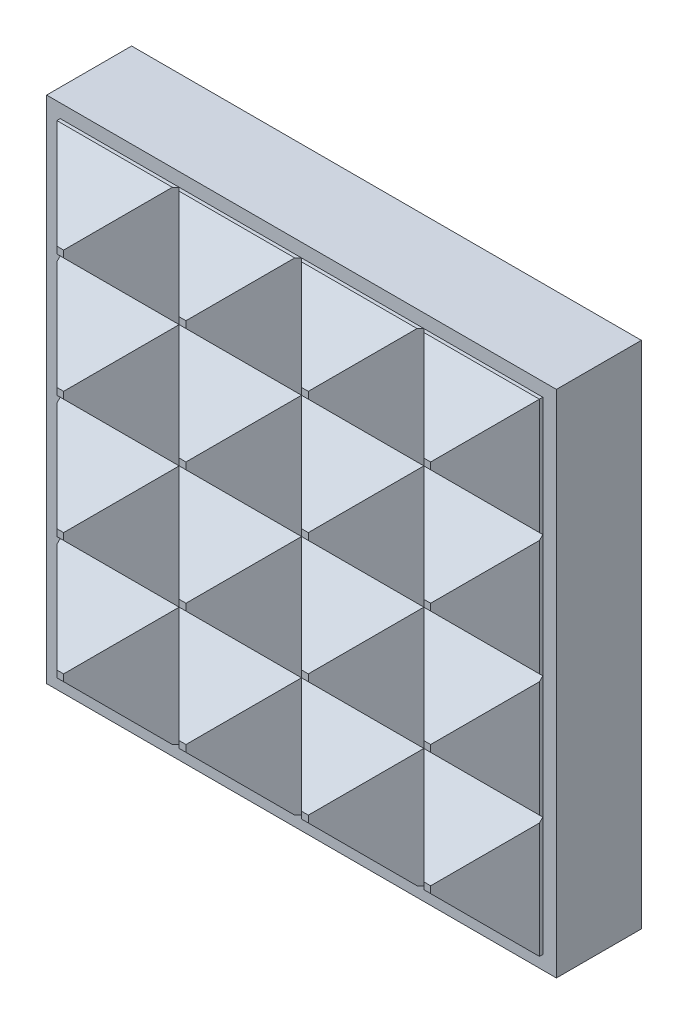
ISO-10303-21;
HEADER;
FILE_DESCRIPTION(('STEP AP214'),'2;1');
FILE_NAME('part.step','',(''),(''),'','','');
FILE_SCHEMA(('AUTOMOTIVE_DESIGN { 1 0 10303 214 1 1 1 1 }'));
ENDSEC;
DATA;
#1=APPLICATION_CONTEXT('core data for automotive mechanical design processes');
#2=APPLICATION_PROTOCOL_DEFINITION('international standard','automotive_design',2000,#1);
#3=PRODUCT_CONTEXT('',#1,'mechanical');
#4=PRODUCT('Part','Part','',(#3));
#5=PRODUCT_RELATED_PRODUCT_CATEGORY('part','',(#4));
#6=PRODUCT_DEFINITION_FORMATION('','',#4);
#7=PRODUCT_DEFINITION_CONTEXT('part definition',#1,'design');
#8=PRODUCT_DEFINITION('design','',#6,#7);
#9=PRODUCT_DEFINITION_SHAPE('','',#8);
#10=(LENGTH_UNIT() NAMED_UNIT(*) SI_UNIT(.MILLI.,.METRE.));
#11=(NAMED_UNIT(*) PLANE_ANGLE_UNIT() SI_UNIT($,.RADIAN.));
#12=(NAMED_UNIT(*) SI_UNIT($,.STERADIAN.) SOLID_ANGLE_UNIT());
#13=UNCERTAINTY_MEASURE_WITH_UNIT(LENGTH_MEASURE(1.E-05),#10,'distance_accuracy_value','');
#14=(GEOMETRIC_REPRESENTATION_CONTEXT(3) GLOBAL_UNCERTAINTY_ASSIGNED_CONTEXT((#13)) GLOBAL_UNIT_ASSIGNED_CONTEXT((#10,
#11,#12)) REPRESENTATION_CONTEXT('',''));
#15=CARTESIAN_POINT('',(0.,0.,0.));
#16=DIRECTION('',(0.,0.,1.));
#17=DIRECTION('',(1.,0.,0.));
#18=AXIS2_PLACEMENT_3D('',#15,#16,#17);
#19=CARTESIAN_POINT('',(-4.7625,0.,2.0955));
#20=DIRECTION('',(0.,-0.707106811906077,-0.707106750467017));
#21=DIRECTION('',(0.,0.707106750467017,-0.707106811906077));
#22=AXIS2_PLACEMENT_3D('',#19,#20,#21);
#23=PLANE('',#22);
#24=DIRECTION('',(1.,0.,0.));
#25=VECTOR('',#24,1.);
#26=CARTESIAN_POINT('',(-4.7625,0.,2.0955));
#27=LINE('',#26,#25);
#28=CARTESIAN_POINT('',(-4.5085,0.,2.0955));
#29=VERTEX_POINT('',#28);
#30=CARTESIAN_POINT('',(-2.286,-1.08528637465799E-13,2.09549999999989));
#31=VERTEX_POINT('',#30);
#32=EDGE_CURVE('E969',#29,#31,#27,.T.);
#33=ORIENTED_EDGE('',*,*,#32,.F.);
#34=DIRECTION('',(0.,-0.707106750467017,0.707106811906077));
#35=VECTOR('',#34,1.);
#36=CARTESIAN_POINT('',(-4.5085,0.,2.0955));
#37=LINE('',#36,#35);
#38=CARTESIAN_POINT('',(-4.5085,-0.0634999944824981,2.15899999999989));
#39=VERTEX_POINT('',#38);
#40=EDGE_CURVE('E484',#29,#39,#37,.T.);
#41=ORIENTED_EDGE('',*,*,#40,.T.);
#42=DIRECTION('',(0.577350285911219,-0.577350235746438,0.577350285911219));
#43=VECTOR('',#42,1.);
#44=CARTESIAN_POINT('',(-4.63550000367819,0.063499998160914,2.03199999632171));
#45=LINE('',#44,#43);
#46=CARTESIAN_POINT('',(-3.49249999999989,-1.07949990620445,3.175));
#47=VERTEX_POINT('',#46);
#48=EDGE_CURVE('E737',#39,#47,#45,.T.);
#49=ORIENTED_EDGE('',*,*,#48,.T.);
#50=DIRECTION('',(1.,0.,0.));
#51=VECTOR('',#50,1.);
#52=CARTESIAN_POINT('',(-4.7625,-1.07949990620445,3.175));
#53=LINE('',#52,#51);
#54=CARTESIAN_POINT('',(-3.36550000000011,-1.07949990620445,3.175));
#55=VERTEX_POINT('',#54);
#56=EDGE_CURVE('E1029',#47,#55,#53,.T.);
#57=ORIENTED_EDGE('',*,*,#56,.T.);
#58=DIRECTION('',(0.577350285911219,0.577350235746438,-0.577350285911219));
#59=VECTOR('',#58,1.);
#60=CARTESIAN_POINT('',(-3.11150004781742,-0.825499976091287,2.9210000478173));
#61=LINE('',#60,#59);
#62=EDGE_CURVE('E705',#55,#31,#61,.T.);
#63=ORIENTED_EDGE('',*,*,#62,.T.);
#64=EDGE_LOOP('',(#33,#41,#49,#57,#63));
#65=FACE_BOUND('',#64,.T.);
#66=ADVANCED_FACE('F15',(#65),#23,.F.);
#67=CARTESIAN_POINT('',(-4.7625,0.,2.0955));
#68=DIRECTION('',(0.,0.707106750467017,-0.707106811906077));
#69=DIRECTION('',(0.,0.707106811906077,0.707106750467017));
#70=AXIS2_PLACEMENT_3D('',#67,#68,#69);
#71=PLANE('',#70);
#72=DIRECTION('',(-0.577350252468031,-0.577350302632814,-0.577350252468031));
#73=VECTOR('',#72,1.);
#74=CARTESIAN_POINT('',(-4.63549999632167,-0.0635000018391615,2.03200000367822));
#75=LINE('',#74,#73);
#76=CARTESIAN_POINT('',(-3.49249999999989,1.07950009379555,3.175));
#77=VERTEX_POINT('',#76);
#78=CARTESIAN_POINT('',(-4.5085,0.063500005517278,2.1589999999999));
#79=VERTEX_POINT('',#78);
#80=EDGE_CURVE('E739',#77,#79,#75,.T.);
#81=ORIENTED_EDGE('',*,*,#80,.T.);
#82=DIRECTION('',(0.,-0.707106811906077,-0.707106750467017));
#83=VECTOR('',#82,1.);
#84=CARTESIAN_POINT('',(-4.5085,0.,2.0955));
#85=LINE('',#84,#83);
#86=EDGE_CURVE('E849',#79,#29,#85,.T.);
#87=ORIENTED_EDGE('',*,*,#86,.T.);
#88=ORIENTED_EDGE('',*,*,#32,.T.);
#89=DIRECTION('',(-0.577350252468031,0.577350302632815,0.577350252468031));
#90=VECTOR('',#89,1.);
#91=CARTESIAN_POINT('',(-3.11149995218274,0.825500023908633,2.92099995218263));
#92=LINE('',#91,#90);
#93=CARTESIAN_POINT('',(-3.36550000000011,1.07950009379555,3.175));
#94=VERTEX_POINT('',#93);
#95=EDGE_CURVE('E708',#31,#94,#92,.T.);
#96=ORIENTED_EDGE('',*,*,#95,.T.);
#97=DIRECTION('',(-1.,0.,0.));
#98=VECTOR('',#97,1.);
#99=CARTESIAN_POINT('',(-4.7625,1.07950009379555,3.175));
#100=LINE('',#99,#98);
#101=EDGE_CURVE('E1045',#94,#77,#100,.T.);
#102=ORIENTED_EDGE('',*,*,#101,.T.);
#103=EDGE_LOOP('',(#81,#87,#88,#96,#102));
#104=FACE_BOUND('',#103,.T.);
#105=ADVANCED_FACE('F1089',(#104),#71,.F.);
#106=CARTESIAN_POINT('',(-4.7625,-2.286,2.0955));
#107=DIRECTION('',(0.,0.707106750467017,-0.707106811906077));
#108=DIRECTION('',(0.,0.707106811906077,0.707106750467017));
#109=AXIS2_PLACEMENT_3D('',#106,#107,#108);
#110=PLANE('',#109);
#111=DIRECTION('',(-0.577350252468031,-0.577350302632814,-0.577350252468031));
#112=VECTOR('',#111,1.);
#113=CARTESIAN_POINT('',(-4.63549999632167,-2.34950000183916,2.03200000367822));
#114=LINE('',#113,#112);
#115=CARTESIAN_POINT('',(-3.49249999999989,-1.20649990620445,3.175));
#116=VERTEX_POINT('',#115);
#117=CARTESIAN_POINT('',(-4.5085,-2.22249999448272,2.1589999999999));
#118=VERTEX_POINT('',#117);
#119=EDGE_CURVE('E493',#116,#118,#114,.T.);
#120=ORIENTED_EDGE('',*,*,#119,.T.);
#121=DIRECTION('',(0.,-0.707106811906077,-0.707106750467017));
#122=VECTOR('',#121,1.);
#123=CARTESIAN_POINT('',(-4.5085,-2.286,2.0955));
#124=LINE('',#123,#122);
#125=CARTESIAN_POINT('',(-4.5085,-2.286,2.0955));
#126=VERTEX_POINT('',#125);
#127=EDGE_CURVE('E38',#118,#126,#124,.T.);
#128=ORIENTED_EDGE('',*,*,#127,.T.);
#129=DIRECTION('',(1.,0.,0.));
#130=VECTOR('',#129,1.);
#131=CARTESIAN_POINT('',(-4.7625,-2.286,2.0955));
#132=LINE('',#131,#130);
#133=CARTESIAN_POINT('',(-2.286,-2.28599999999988,2.09549999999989));
#134=VERTEX_POINT('',#133);
#135=EDGE_CURVE('E490',#126,#134,#132,.T.);
#136=ORIENTED_EDGE('',*,*,#135,.T.);
#137=DIRECTION('',(-0.577350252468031,0.577350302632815,0.577350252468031));
#138=VECTOR('',#137,1.);
#139=CARTESIAN_POINT('',(-3.11149995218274,-1.46049997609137,2.92099995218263));
#140=LINE('',#139,#138);
#141=CARTESIAN_POINT('',(-3.36550000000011,-1.20649990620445,3.175));
#142=VERTEX_POINT('',#141);
#143=EDGE_CURVE('E701',#134,#142,#140,.T.);
#144=ORIENTED_EDGE('',*,*,#143,.T.);
#145=DIRECTION('',(-1.,0.,0.));
#146=VECTOR('',#145,1.);
#147=CARTESIAN_POINT('',(-4.7625,-1.20649990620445,3.175));
#148=LINE('',#147,#146);
#149=EDGE_CURVE('E508',#142,#116,#148,.T.);
#150=ORIENTED_EDGE('',*,*,#149,.T.);
#151=EDGE_LOOP('',(#120,#128,#136,#144,#150));
#152=FACE_BOUND('',#151,.T.);
#153=ADVANCED_FACE('F488',(#152),#110,.F.);
#154=CARTESIAN_POINT('',(-4.7625,-2.286,2.0955));
#155=DIRECTION('',(0.,-0.707106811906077,-0.707106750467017));
#156=DIRECTION('',(0.,0.707106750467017,-0.707106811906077));
#157=AXIS2_PLACEMENT_3D('',#154,#155,#156);
#158=PLANE('',#157);
#159=ORIENTED_EDGE('',*,*,#135,.F.);
#160=DIRECTION('',(0.,-0.707106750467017,0.707106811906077));
#161=VECTOR('',#160,1.);
#162=CARTESIAN_POINT('',(-4.5085,-2.286,2.0955));
#163=LINE('',#162,#161);
#164=CARTESIAN_POINT('',(-4.5085,-2.3494999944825,2.1589999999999));
#165=VERTEX_POINT('',#164);
#166=EDGE_CURVE('E448',#126,#165,#163,.T.);
#167=ORIENTED_EDGE('',*,*,#166,.T.);
#168=DIRECTION('',(0.577350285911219,-0.577350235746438,0.577350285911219));
#169=VECTOR('',#168,1.);
#170=CARTESIAN_POINT('',(-4.63550000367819,-2.22250000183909,2.03199999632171));
#171=LINE('',#170,#169);
#172=CARTESIAN_POINT('',(-3.49249999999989,-3.36549990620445,3.175));
#173=VERTEX_POINT('',#172);
#174=EDGE_CURVE('E731',#165,#173,#171,.T.);
#175=ORIENTED_EDGE('',*,*,#174,.T.);
#176=DIRECTION('',(1.,0.,0.));
#177=VECTOR('',#176,1.);
#178=CARTESIAN_POINT('',(-4.7625,-3.36549990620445,3.175));
#179=LINE('',#178,#177);
#180=CARTESIAN_POINT('',(-3.36550000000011,-3.36549990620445,3.175));
#181=VERTEX_POINT('',#180);
#182=EDGE_CURVE('E1011',#173,#181,#179,.T.);
#183=ORIENTED_EDGE('',*,*,#182,.T.);
#184=DIRECTION('',(0.577350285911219,0.577350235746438,-0.577350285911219));
#185=VECTOR('',#184,1.);
#186=CARTESIAN_POINT('',(-3.11150004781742,-3.11149997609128,2.9210000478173));
#187=LINE('',#186,#185);
#188=EDGE_CURVE('E501',#181,#134,#187,.T.);
#189=ORIENTED_EDGE('',*,*,#188,.T.);
#190=EDGE_LOOP('',(#159,#167,#175,#183,#189));
#191=FACE_BOUND('',#190,.T.);
#192=ADVANCED_FACE('F498',(#191),#158,.F.);
#193=CARTESIAN_POINT('',(-4.7625,-4.572,2.0955));
#194=DIRECTION('',(0.,0.707106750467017,-0.707106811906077));
#195=DIRECTION('',(0.,0.707106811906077,0.707106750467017));
#196=AXIS2_PLACEMENT_3D('',#193,#194,#195);
#197=PLANE('',#196);
#198=DIRECTION('',(-0.577350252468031,-0.577350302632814,-0.577350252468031));
#199=VECTOR('',#198,1.);
#200=CARTESIAN_POINT('',(-4.63549999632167,-4.63550000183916,2.03200000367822));
#201=LINE('',#200,#199);
#202=CARTESIAN_POINT('',(-3.49249999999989,-3.49249990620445,3.175));
#203=VERTEX_POINT('',#202);
#204=CARTESIAN_POINT('',(-4.5085,-4.5085,2.1589999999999));
#205=VERTEX_POINT('',#204);
#206=EDGE_CURVE('E725',#203,#205,#201,.T.);
#207=ORIENTED_EDGE('',*,*,#206,.T.);
#208=DIRECTION('',(1.,0.,0.));
#209=VECTOR('',#208,1.);
#210=CARTESIAN_POINT('',(-4.7625,-4.5085,2.15899999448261));
#211=LINE('',#210,#209);
#212=CARTESIAN_POINT('',(-2.34949999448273,-4.5085,2.15899999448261));
#213=VERTEX_POINT('',#212);
#214=EDGE_CURVE('E439',#205,#213,#211,.T.);
#215=ORIENTED_EDGE('',*,*,#214,.T.);
#216=DIRECTION('',(-0.577350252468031,0.577350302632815,0.577350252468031));
#217=VECTOR('',#216,1.);
#218=CARTESIAN_POINT('',(-3.11149995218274,-3.74649997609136,2.92099995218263));
#219=LINE('',#218,#217);
#220=CARTESIAN_POINT('',(-3.36550000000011,-3.49249990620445,3.175));
#221=VERTEX_POINT('',#220);
#222=EDGE_CURVE('E695',#213,#221,#219,.T.);
#223=ORIENTED_EDGE('',*,*,#222,.T.);
#224=DIRECTION('',(-1.,0.,0.));
#225=VECTOR('',#224,1.);
#226=CARTESIAN_POINT('',(-4.7625,-3.49249990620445,3.175));
#227=LINE('',#226,#225);
#228=EDGE_CURVE('E535',#221,#203,#227,.T.);
#229=ORIENTED_EDGE('',*,*,#228,.T.);
#230=EDGE_LOOP('',(#207,#215,#223,#229));
#231=FACE_BOUND('',#230,.T.);
#232=ADVANCED_FACE('F1370',(#231),#197,.F.);
#233=CARTESIAN_POINT('',(-4.7625,2.286,2.0955));
#234=DIRECTION('',(0.,-0.707106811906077,-0.707106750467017));
#235=DIRECTION('',(0.,0.707106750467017,-0.707106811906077));
#236=AXIS2_PLACEMENT_3D('',#233,#234,#235);
#237=PLANE('',#236);
#238=DIRECTION('',(1.,0.,0.));
#239=VECTOR('',#238,1.);
#240=CARTESIAN_POINT('',(-4.7625,2.286,2.0955));
#241=LINE('',#240,#239);
#242=CARTESIAN_POINT('',(-4.5085,2.286,2.0955));
#243=VERTEX_POINT('',#242);
#244=CARTESIAN_POINT('',(-2.286,2.28599999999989,2.09549999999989));
#245=VERTEX_POINT('',#244);
#246=EDGE_CURVE('E561',#243,#245,#241,.T.);
#247=ORIENTED_EDGE('',*,*,#246,.F.);
#248=DIRECTION('',(0.,-0.707106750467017,0.707106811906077));
#249=VECTOR('',#248,1.);
#250=CARTESIAN_POINT('',(-4.5085,2.286,2.0955));
#251=LINE('',#250,#249);
#252=CARTESIAN_POINT('',(-4.5085,2.2225000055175,2.15899999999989));
#253=VERTEX_POINT('',#252);
#254=EDGE_CURVE('E841',#243,#253,#251,.T.);
#255=ORIENTED_EDGE('',*,*,#254,.T.);
#256=DIRECTION('',(0.577350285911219,-0.577350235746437,0.577350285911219));
#257=VECTOR('',#256,1.);
#258=CARTESIAN_POINT('',(-4.63550000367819,2.34949999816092,2.03199999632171));
#259=LINE('',#258,#257);
#260=CARTESIAN_POINT('',(-3.49249999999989,1.20650009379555,3.175));
#261=VERTEX_POINT('',#260);
#262=EDGE_CURVE('E745',#253,#261,#259,.T.);
#263=ORIENTED_EDGE('',*,*,#262,.T.);
#264=DIRECTION('',(1.,0.,0.));
#265=VECTOR('',#264,1.);
#266=CARTESIAN_POINT('',(-4.7625,1.20650009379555,3.175));
#267=LINE('',#266,#265);
#268=CARTESIAN_POINT('',(-3.36550000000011,1.20650009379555,3.175));
#269=VERTEX_POINT('',#268);
#270=EDGE_CURVE('E545',#261,#269,#267,.T.);
#271=ORIENTED_EDGE('',*,*,#270,.T.);
#272=DIRECTION('',(0.577350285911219,0.577350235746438,-0.577350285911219));
#273=VECTOR('',#272,1.);
#274=CARTESIAN_POINT('',(-3.11150004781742,1.46050002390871,2.9210000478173));
#275=LINE('',#274,#273);
#276=EDGE_CURVE('E713',#269,#245,#275,.T.);
#277=ORIENTED_EDGE('',*,*,#276,.T.);
#278=EDGE_LOOP('',(#247,#255,#263,#271,#277));
#279=FACE_BOUND('',#278,.T.);
#280=ADVANCED_FACE('F1081',(#279),#237,.F.);
#281=CARTESIAN_POINT('',(-4.7625,2.286,2.0955));
#282=DIRECTION('',(0.,0.707106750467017,-0.707106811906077));
#283=DIRECTION('',(0.,0.707106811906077,0.707106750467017));
#284=AXIS2_PLACEMENT_3D('',#281,#282,#283);
#285=PLANE('',#284);
#286=DIRECTION('',(-0.577350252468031,-0.577350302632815,-0.577350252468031));
#287=VECTOR('',#286,1.);
#288=CARTESIAN_POINT('',(-4.63549999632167,2.22249999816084,2.03200000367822));
#289=LINE('',#288,#287);
#290=CARTESIAN_POINT('',(-3.49249999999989,3.36550009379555,3.175));
#291=VERTEX_POINT('',#290);
#292=CARTESIAN_POINT('',(-4.5085,2.34950000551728,2.15899999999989));
#293=VERTEX_POINT('',#292);
#294=EDGE_CURVE('E747',#291,#293,#289,.T.);
#295=ORIENTED_EDGE('',*,*,#294,.T.);
#296=DIRECTION('',(0.,-0.707106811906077,-0.707106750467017));
#297=VECTOR('',#296,1.);
#298=CARTESIAN_POINT('',(-4.5085,2.286,2.0955));
#299=LINE('',#298,#297);
#300=EDGE_CURVE('E839',#293,#243,#299,.T.);
#301=ORIENTED_EDGE('',*,*,#300,.T.);
#302=ORIENTED_EDGE('',*,*,#246,.T.);
#303=DIRECTION('',(-0.577350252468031,0.577350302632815,0.577350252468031));
#304=VECTOR('',#303,1.);
#305=CARTESIAN_POINT('',(-3.11149995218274,3.11150002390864,2.92099995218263));
#306=LINE('',#305,#304);
#307=CARTESIAN_POINT('',(-3.36550000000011,3.36550009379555,3.175));
#308=VERTEX_POINT('',#307);
#309=EDGE_CURVE('E716',#245,#308,#306,.T.);
#310=ORIENTED_EDGE('',*,*,#309,.T.);
#311=DIRECTION('',(-1.,0.,0.));
#312=VECTOR('',#311,1.);
#313=CARTESIAN_POINT('',(-4.7625,3.36550009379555,3.175));
#314=LINE('',#313,#312);
#315=EDGE_CURVE('E557',#308,#291,#314,.T.);
#316=ORIENTED_EDGE('',*,*,#315,.T.);
#317=EDGE_LOOP('',(#295,#301,#302,#310,#316));
#318=FACE_BOUND('',#317,.T.);
#319=ADVANCED_FACE('F1224',(#318),#285,.F.);
#320=CARTESIAN_POINT('',(-4.7625,4.572,2.0955));
#321=DIRECTION('',(0.,-0.707106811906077,-0.707106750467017));
#322=DIRECTION('',(0.,0.707106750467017,-0.707106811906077));
#323=AXIS2_PLACEMENT_3D('',#320,#321,#322);
#324=PLANE('',#323);
#325=DIRECTION('',(0.577350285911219,0.577350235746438,-0.577350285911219));
#326=VECTOR('',#325,1.);
#327=CARTESIAN_POINT('',(-3.11150004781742,3.74650002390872,2.9210000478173));
#328=LINE('',#327,#326);
#329=CARTESIAN_POINT('',(-3.36550000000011,3.49250009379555,3.175));
#330=VERTEX_POINT('',#329);
#331=CARTESIAN_POINT('',(-2.3495000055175,4.5085,2.15900000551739));
#332=VERTEX_POINT('',#331);
#333=EDGE_CURVE('E957',#330,#332,#328,.T.);
#334=ORIENTED_EDGE('',*,*,#333,.T.);
#335=DIRECTION('',(-1.,0.,0.));
#336=VECTOR('',#335,1.);
#337=CARTESIAN_POINT('',(-4.7625,4.5085,2.15900000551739));
#338=LINE('',#337,#336);
#339=CARTESIAN_POINT('',(-4.5085,4.5085,2.15899999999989));
#340=VERTEX_POINT('',#339);
#341=EDGE_CURVE('E797',#332,#340,#338,.T.);
#342=ORIENTED_EDGE('',*,*,#341,.T.);
#343=DIRECTION('',(0.577350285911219,-0.577350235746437,0.577350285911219));
#344=VECTOR('',#343,1.);
#345=CARTESIAN_POINT('',(-4.63550000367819,4.63549999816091,2.03199999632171));
#346=LINE('',#345,#344);
#347=CARTESIAN_POINT('',(-3.49249999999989,3.49250009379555,3.175));
#348=VERTEX_POINT('',#347);
#349=EDGE_CURVE('E962',#340,#348,#346,.T.);
#350=ORIENTED_EDGE('',*,*,#349,.T.);
#351=DIRECTION('',(1.,0.,0.));
#352=VECTOR('',#351,1.);
#353=CARTESIAN_POINT('',(-4.7625,3.49250009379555,3.175));
#354=LINE('',#353,#352);
#355=EDGE_CURVE('E570',#348,#330,#354,.T.);
#356=ORIENTED_EDGE('',*,*,#355,.T.);
#357=EDGE_LOOP('',(#334,#342,#350,#356));
#358=FACE_BOUND('',#357,.T.);
#359=ADVANCED_FACE('F1216',(#358),#324,.F.);
#360=CARTESIAN_POINT('',(-4.7625,-4.7625,3.175));
#361=DIRECTION('',(0.,0.,1.));
#362=DIRECTION('',(1.,0.,0.));
#363=AXIS2_PLACEMENT_3D('',#360,#361,#362);
#364=PLANE('',#363);
#365=DIRECTION('',(0.,1.,0.));
#366=VECTOR('',#365,1.);
#367=CARTESIAN_POINT('',(-1.2064999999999,-4.7625,3.175));
#368=LINE('',#367,#366);
#369=CARTESIAN_POINT('',(-1.2064999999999,1.07950009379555,3.175));
#370=VERTEX_POINT('',#369);
#371=CARTESIAN_POINT('',(-1.20649999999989,1.20650009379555,3.175));
#372=VERTEX_POINT('',#371);
#373=EDGE_CURVE('E684',#370,#372,#368,.T.);
#374=ORIENTED_EDGE('',*,*,#373,.F.);
#375=CARTESIAN_POINT('',(-1.07950000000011,1.07950009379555,3.175));
#376=VERTEX_POINT('',#375);
#377=EDGE_CURVE('E1046',#376,#370,#100,.T.);
#378=ORIENTED_EDGE('',*,*,#377,.F.);
#379=DIRECTION('',(0.,-1.,0.));
#380=VECTOR('',#379,1.);
#381=CARTESIAN_POINT('',(-1.07950000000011,-4.7625,3.175));
#382=LINE('',#381,#380);
#383=CARTESIAN_POINT('',(-1.07950000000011,1.20650009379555,3.175));
#384=VERTEX_POINT('',#383);
#385=EDGE_CURVE('E1005',#384,#376,#382,.T.);
#386=ORIENTED_EDGE('',*,*,#385,.F.);
#387=EDGE_CURVE('E547',#372,#384,#267,.T.);
#388=ORIENTED_EDGE('',*,*,#387,.F.);
#389=EDGE_LOOP('',(#374,#378,#386,#388));
#390=FACE_BOUND('',#389,.T.);
#391=ADVANCED_FACE('F1059',(#390),#364,.T.);
#392=DIRECTION('',(0.,1.,0.));
#393=VECTOR('',#392,1.);
#394=CARTESIAN_POINT('',(-1.2064999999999,-4.7625,3.175));
#395=LINE('',#394,#393);
#396=CARTESIAN_POINT('',(-1.2064999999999,-3.49249990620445,3.175));
#397=VERTEX_POINT('',#396);
#398=CARTESIAN_POINT('',(-1.20649999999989,-3.36549990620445,3.175));
#399=VERTEX_POINT('',#398);
#400=EDGE_CURVE('E669',#397,#399,#395,.T.);
#401=ORIENTED_EDGE('',*,*,#400,.F.);
#402=CARTESIAN_POINT('',(-1.07950000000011,-3.49249990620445,3.175));
#403=VERTEX_POINT('',#402);
#404=EDGE_CURVE('E531',#403,#397,#227,.T.);
#405=ORIENTED_EDGE('',*,*,#404,.F.);
#406=DIRECTION('',(0.,-1.,0.));
#407=VECTOR('',#406,1.);
#408=CARTESIAN_POINT('',(-1.07950000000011,-4.7625,3.175));
#409=LINE('',#408,#407);
#410=CARTESIAN_POINT('',(-1.07950000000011,-3.36549990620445,3.175));
#411=VERTEX_POINT('',#410);
#412=EDGE_CURVE('E1003',#411,#403,#409,.T.);
#413=ORIENTED_EDGE('',*,*,#412,.F.);
#414=EDGE_CURVE('E1013',#399,#411,#179,.T.);
#415=ORIENTED_EDGE('',*,*,#414,.F.);
#416=EDGE_LOOP('',(#401,#405,#413,#415));
#417=FACE_BOUND('',#416,.T.);
#418=ADVANCED_FACE('F1215',(#417),#364,.T.);
#419=DIRECTION('',(0.,1.,0.));
#420=VECTOR('',#419,1.);
#421=CARTESIAN_POINT('',(-1.2064999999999,-4.7625,3.175));
#422=LINE('',#421,#420);
#423=CARTESIAN_POINT('',(-1.2064999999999,-1.20649990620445,3.175));
#424=VERTEX_POINT('',#423);
#425=CARTESIAN_POINT('',(-1.2064999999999,-1.07949990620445,3.175));
#426=VERTEX_POINT('',#425);
#427=EDGE_CURVE('E676',#424,#426,#422,.T.);
#428=ORIENTED_EDGE('',*,*,#427,.F.);
#429=CARTESIAN_POINT('',(-1.07950000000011,-1.20649990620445,3.175));
#430=VERTEX_POINT('',#429);
#431=EDGE_CURVE('E1019',#430,#424,#148,.T.);
#432=ORIENTED_EDGE('',*,*,#431,.F.);
#433=CARTESIAN_POINT('',(-1.07950000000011,-1.07949990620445,3.175));
#434=VERTEX_POINT('',#433);
#435=EDGE_CURVE('E1000',#434,#430,#409,.T.);
#436=ORIENTED_EDGE('',*,*,#435,.F.);
#437=EDGE_CURVE('E1030',#426,#434,#53,.T.);
#438=ORIENTED_EDGE('',*,*,#437,.F.);
#439=EDGE_LOOP('',(#428,#432,#436,#438));
#440=FACE_BOUND('',#439,.T.);
#441=ADVANCED_FACE('F1222',(#440),#364,.T.);
#442=DIRECTION('',(0.,1.,0.));
#443=VECTOR('',#442,1.);
#444=CARTESIAN_POINT('',(-1.2064999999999,-4.7625,3.175));
#445=LINE('',#444,#443);
#446=CARTESIAN_POINT('',(-1.2064999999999,3.36550009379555,3.175));
#447=VERTEX_POINT('',#446);
#448=CARTESIAN_POINT('',(-1.20649999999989,3.49250009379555,3.175));
#449=VERTEX_POINT('',#448);
#450=EDGE_CURVE('E692',#447,#449,#445,.T.);
#451=ORIENTED_EDGE('',*,*,#450,.F.);
#452=CARTESIAN_POINT('',(-1.07950000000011,3.36550009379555,3.175));
#453=VERTEX_POINT('',#452);
#454=EDGE_CURVE('E554',#453,#447,#314,.T.);
#455=ORIENTED_EDGE('',*,*,#454,.F.);
#456=CARTESIAN_POINT('',(-1.07950000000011,3.49250009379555,3.175));
#457=VERTEX_POINT('',#456);
#458=EDGE_CURVE('E927',#457,#453,#382,.T.);
#459=ORIENTED_EDGE('',*,*,#458,.F.);
#460=EDGE_CURVE('E572',#449,#457,#354,.T.);
#461=ORIENTED_EDGE('',*,*,#460,.F.);
#462=EDGE_LOOP('',(#451,#455,#459,#461));
#463=FACE_BOUND('',#462,.T.);
#464=ADVANCED_FACE('F1177',(#463),#364,.T.);
#465=CARTESIAN_POINT('',(0.,-1.0842021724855E-13,2.09549999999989));
#466=VERTEX_POINT('',#465);
#467=EDGE_CURVE('E974',#31,#466,#27,.T.);
#468=ORIENTED_EDGE('',*,*,#467,.F.);
#469=DIRECTION('',(0.577350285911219,-0.577350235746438,0.577350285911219));
#470=VECTOR('',#469,1.);
#471=CARTESIAN_POINT('',(-3.11150004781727,0.825499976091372,1.26999995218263));
#472=LINE('',#471,#470);
#473=EDGE_CURVE('E678',#31,#426,#472,.T.);
#474=ORIENTED_EDGE('',*,*,#473,.T.);
#475=ORIENTED_EDGE('',*,*,#437,.T.);
#476=DIRECTION('',(0.577350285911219,0.577350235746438,-0.577350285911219));
#477=VECTOR('',#476,1.);
#478=CARTESIAN_POINT('',(-1.58750009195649,-1.58749995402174,3.68300009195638));
#479=LINE('',#478,#477);
#480=EDGE_CURVE('E1006',#434,#466,#479,.T.);
#481=ORIENTED_EDGE('',*,*,#480,.T.);
#482=EDGE_LOOP('',(#468,#474,#475,#481));
#483=FACE_BOUND('',#482,.T.);
#484=ADVANCED_FACE('F1165',(#483),#23,.F.);
#485=ORIENTED_EDGE('',*,*,#377,.T.);
#486=DIRECTION('',(-0.577350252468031,-0.577350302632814,-0.577350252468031));
#487=VECTOR('',#486,1.);
#488=CARTESIAN_POINT('',(-3.11149995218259,-0.825500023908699,1.2700000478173));
#489=LINE('',#488,#487);
#490=EDGE_CURVE('E681',#370,#31,#489,.T.);
#491=ORIENTED_EDGE('',*,*,#490,.T.);
#492=ORIENTED_EDGE('',*,*,#467,.T.);
#493=DIRECTION('',(-0.577350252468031,0.577350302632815,0.577350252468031));
#494=VECTOR('',#493,1.);
#495=CARTESIAN_POINT('',(-1.58749990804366,1.58750004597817,3.68299990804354));
#496=LINE('',#495,#494);
#497=EDGE_CURVE('E939',#466,#376,#496,.T.);
#498=ORIENTED_EDGE('',*,*,#497,.T.);
#499=EDGE_LOOP('',(#485,#491,#492,#498));
#500=FACE_BOUND('',#499,.T.);
#501=ADVANCED_FACE('F1055',(#500),#71,.F.);
#502=ORIENTED_EDGE('',*,*,#431,.T.);
#503=DIRECTION('',(-0.577350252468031,-0.577350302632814,-0.577350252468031));
#504=VECTOR('',#503,1.);
#505=CARTESIAN_POINT('',(-3.11149995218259,-3.1115000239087,1.2700000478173));
#506=LINE('',#505,#504);
#507=EDGE_CURVE('E674',#424,#134,#506,.T.);
#508=ORIENTED_EDGE('',*,*,#507,.T.);
#509=CARTESIAN_POINT('',(0.,-2.28600000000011,2.09549999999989));
#510=VERTEX_POINT('',#509);
#511=EDGE_CURVE('E504',#134,#510,#132,.T.);
#512=ORIENTED_EDGE('',*,*,#511,.T.);
#513=DIRECTION('',(0.577350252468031,-0.577350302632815,-0.577350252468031));
#514=VECTOR('',#513,1.);
#515=CARTESIAN_POINT('',(0.825500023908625,-3.11150009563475,1.26999997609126));
#516=LINE('',#515,#514);
#517=EDGE_CURVE('E1282',#430,#510,#516,.T.);
#518=ORIENTED_EDGE('',*,*,#517,.F.);
#519=EDGE_LOOP('',(#502,#508,#512,#518));
#520=FACE_BOUND('',#519,.T.);
#521=ADVANCED_FACE('F1169',(#520),#110,.F.);
#522=ORIENTED_EDGE('',*,*,#511,.F.);
#523=DIRECTION('',(0.577350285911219,-0.577350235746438,0.577350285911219));
#524=VECTOR('',#523,1.);
#525=CARTESIAN_POINT('',(-3.11150004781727,-1.46050002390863,1.26999995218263));
#526=LINE('',#525,#524);
#527=EDGE_CURVE('E671',#134,#399,#526,.T.);
#528=ORIENTED_EDGE('',*,*,#527,.T.);
#529=ORIENTED_EDGE('',*,*,#414,.T.);
#530=DIRECTION('',(-0.577350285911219,-0.577350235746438,0.577350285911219));
#531=VECTOR('',#530,1.);
#532=CARTESIAN_POINT('',(-0.825499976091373,-3.11149990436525,2.92099997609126));
#533=LINE('',#532,#531);
#534=EDGE_CURVE('E916',#510,#411,#533,.T.);
#535=ORIENTED_EDGE('',*,*,#534,.F.);
#536=EDGE_LOOP('',(#522,#528,#529,#535));
#537=FACE_BOUND('',#536,.T.);
#538=ADVANCED_FACE('F1161',(#537),#158,.F.);
#539=DIRECTION('',(-0.577350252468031,-0.577350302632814,-0.577350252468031));
#540=VECTOR('',#539,1.);
#541=CARTESIAN_POINT('',(-3.11149995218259,-5.3975000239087,1.2700000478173));
#542=LINE('',#541,#540);
#543=CARTESIAN_POINT('',(-2.22250000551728,-4.5085,2.15899999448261));
#544=VERTEX_POINT('',#543);
#545=EDGE_CURVE('E666',#397,#544,#542,.T.);
#546=ORIENTED_EDGE('',*,*,#545,.T.);
#547=DIRECTION('',(1.,0.,0.));
#548=VECTOR('',#547,1.);
#549=CARTESIAN_POINT('',(-4.7625,-4.5085,2.15899999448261));
#550=LINE('',#549,#548);
#551=CARTESIAN_POINT('',(-0.0634999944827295,-4.5085,2.15899999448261));
#552=VERTEX_POINT('',#551);
#553=EDGE_CURVE('E828',#544,#552,#550,.T.);
#554=ORIENTED_EDGE('',*,*,#553,.T.);
#555=DIRECTION('',(0.577350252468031,-0.577350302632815,-0.577350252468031));
#556=VECTOR('',#555,1.);
#557=CARTESIAN_POINT('',(0.0635000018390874,-4.63550000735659,2.0319999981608));
#558=LINE('',#557,#556);
#559=EDGE_CURVE('E538',#403,#552,#558,.T.);
#560=ORIENTED_EDGE('',*,*,#559,.F.);
#561=ORIENTED_EDGE('',*,*,#404,.T.);
#562=EDGE_LOOP('',(#546,#554,#560,#561));
#563=FACE_BOUND('',#562,.T.);
#564=ADVANCED_FACE('F1298',(#563),#197,.F.);
#565=CARTESIAN_POINT('',(1.07769695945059E-13,2.286,2.0955));
#566=VERTEX_POINT('',#565);
#567=EDGE_CURVE('E563',#245,#566,#241,.T.);
#568=ORIENTED_EDGE('',*,*,#567,.F.);
#569=DIRECTION('',(0.577350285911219,-0.577350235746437,0.577350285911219));
#570=VECTOR('',#569,1.);
#571=CARTESIAN_POINT('',(-3.11150004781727,3.11149997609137,1.26999995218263));
#572=LINE('',#571,#570);
#573=EDGE_CURVE('E686',#245,#372,#572,.T.);
#574=ORIENTED_EDGE('',*,*,#573,.T.);
#575=ORIENTED_EDGE('',*,*,#387,.T.);
#576=DIRECTION('',(-0.577350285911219,-0.577350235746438,0.577350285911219));
#577=VECTOR('',#576,1.);
#578=CARTESIAN_POINT('',(-2.34949993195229,-0.063499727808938,4.44499993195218));
#579=LINE('',#578,#577);
#580=EDGE_CURVE('E548',#566,#384,#579,.T.);
#581=ORIENTED_EDGE('',*,*,#580,.F.);
#582=EDGE_LOOP('',(#568,#574,#575,#581));
#583=FACE_BOUND('',#582,.T.);
#584=ADVANCED_FACE('F900',(#583),#237,.F.);
#585=ORIENTED_EDGE('',*,*,#454,.T.);
#586=DIRECTION('',(-0.577350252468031,-0.577350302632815,-0.577350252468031));
#587=VECTOR('',#586,1.);
#588=CARTESIAN_POINT('',(-3.11149995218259,1.4604999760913,1.2700000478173));
#589=LINE('',#588,#587);
#590=EDGE_CURVE('E689',#447,#245,#589,.T.);
#591=ORIENTED_EDGE('',*,*,#590,.T.);
#592=ORIENTED_EDGE('',*,*,#567,.T.);
#593=DIRECTION('',(0.577350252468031,-0.577350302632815,-0.577350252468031));
#594=VECTOR('',#593,1.);
#595=CARTESIAN_POINT('',(2.3495000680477,-0.0635002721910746,-0.254000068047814));
#596=LINE('',#595,#594);
#597=EDGE_CURVE('E558',#453,#566,#596,.T.);
#598=ORIENTED_EDGE('',*,*,#597,.F.);
#599=EDGE_LOOP('',(#585,#591,#592,#598));
#600=FACE_BOUND('',#599,.T.);
#601=ADVANCED_FACE('F896',(#600),#285,.F.);
#602=DIRECTION('',(-0.577350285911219,-0.577350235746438,0.577350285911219));
#603=VECTOR('',#602,1.);
#604=CARTESIAN_POINT('',(-3.11149990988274,1.46050036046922,5.20699990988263));
#605=LINE('',#604,#603);
#606=CARTESIAN_POINT('',(-0.0635000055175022,4.5085,2.15900000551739));
#607=VERTEX_POINT('',#606);
#608=EDGE_CURVE('E573',#607,#457,#605,.T.);
#609=ORIENTED_EDGE('',*,*,#608,.F.);
#610=DIRECTION('',(-1.,0.,0.));
#611=VECTOR('',#610,1.);
#612=CARTESIAN_POINT('',(-4.7625,4.5085,2.15900000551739));
#613=LINE('',#612,#611);
#614=CARTESIAN_POINT('',(-2.22249999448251,4.5085,2.15900000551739));
#615=VERTEX_POINT('',#614);
#616=EDGE_CURVE('E800',#607,#615,#613,.T.);
#617=ORIENTED_EDGE('',*,*,#616,.T.);
#618=DIRECTION('',(0.577350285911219,-0.577350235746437,0.577350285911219));
#619=VECTOR('',#618,1.);
#620=CARTESIAN_POINT('',(-3.11150004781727,5.39749997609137,1.26999995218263));
#621=LINE('',#620,#619);
#622=EDGE_CURVE('E960',#615,#449,#621,.T.);
#623=ORIENTED_EDGE('',*,*,#622,.T.);
#624=ORIENTED_EDGE('',*,*,#460,.T.);
#625=EDGE_LOOP('',(#609,#617,#623,#624));
#626=FACE_BOUND('',#625,.T.);
#627=ADVANCED_FACE('F1227',(#626),#324,.F.);
#628=DIRECTION('',(0.,-1.,0.));
#629=VECTOR('',#628,1.);
#630=CARTESIAN_POINT('',(3.49249999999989,-4.7625,3.175));
#631=LINE('',#630,#629);
#632=CARTESIAN_POINT('',(3.49249999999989,1.20650009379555,3.175));
#633=VERTEX_POINT('',#632);
#634=CARTESIAN_POINT('',(3.49249999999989,1.07950009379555,3.175));
#635=VERTEX_POINT('',#634);
#636=EDGE_CURVE('E652',#633,#635,#631,.T.);
#637=ORIENTED_EDGE('',*,*,#636,.F.);
#638=DIRECTION('',(1.,0.,0.));
#639=VECTOR('',#638,1.);
#640=CARTESIAN_POINT('',(-4.7625,1.20650009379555,3.175));
#641=LINE('',#640,#639);
#642=CARTESIAN_POINT('',(3.3655000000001,1.20650009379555,3.175));
#643=VERTEX_POINT('',#642);
#644=EDGE_CURVE('E544',#643,#633,#641,.T.);
#645=ORIENTED_EDGE('',*,*,#644,.F.);
#646=DIRECTION('',(0.,1.,0.));
#647=VECTOR('',#646,1.);
#648=CARTESIAN_POINT('',(3.3655000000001,-4.7625,3.175));
#649=LINE('',#648,#647);
#650=CARTESIAN_POINT('',(3.3655000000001,1.07950009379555,3.175));
#651=VERTEX_POINT('',#650);
#652=EDGE_CURVE('E592',#651,#643,#649,.T.);
#653=ORIENTED_EDGE('',*,*,#652,.F.);
#654=EDGE_CURVE('E1041',#635,#651,#100,.T.);
#655=ORIENTED_EDGE('',*,*,#654,.F.);
#656=EDGE_LOOP('',(#637,#645,#653,#655));
#657=FACE_BOUND('',#656,.T.);
#658=ADVANCED_FACE('F1141',(#657),#364,.T.);
#659=DIRECTION('',(0.,-1.,0.));
#660=VECTOR('',#659,1.);
#661=CARTESIAN_POINT('',(3.49249999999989,-4.7625,3.175));
#662=LINE('',#661,#660);
#663=CARTESIAN_POINT('',(3.49249999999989,-3.36549990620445,3.175));
#664=VERTEX_POINT('',#663);
#665=CARTESIAN_POINT('',(3.49249999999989,-3.49249990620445,3.175));
#666=VERTEX_POINT('',#665);
#667=EDGE_CURVE('E636',#664,#666,#662,.T.);
#668=ORIENTED_EDGE('',*,*,#667,.F.);
#669=DIRECTION('',(1.,0.,0.));
#670=VECTOR('',#669,1.);
#671=CARTESIAN_POINT('',(-4.7625,-3.36549990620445,3.175));
#672=LINE('',#671,#670);
#673=CARTESIAN_POINT('',(3.3655000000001,-3.36549990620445,3.175));
#674=VERTEX_POINT('',#673);
#675=EDGE_CURVE('E1010',#674,#664,#672,.T.);
#676=ORIENTED_EDGE('',*,*,#675,.F.);
#677=DIRECTION('',(0.,1.,0.));
#678=VECTOR('',#677,1.);
#679=CARTESIAN_POINT('',(3.3655000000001,-4.7625,3.175));
#680=LINE('',#679,#678);
#681=CARTESIAN_POINT('',(3.3655000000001,-3.49249990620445,3.175));
#682=VERTEX_POINT('',#681);
#683=EDGE_CURVE('E577',#682,#674,#680,.T.);
#684=ORIENTED_EDGE('',*,*,#683,.F.);
#685=DIRECTION('',(-1.,0.,0.));
#686=VECTOR('',#685,1.);
#687=CARTESIAN_POINT('',(-4.7625,-3.49249990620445,3.175));
#688=LINE('',#687,#686);
#689=EDGE_CURVE('E520',#666,#682,#688,.T.);
#690=ORIENTED_EDGE('',*,*,#689,.F.);
#691=EDGE_LOOP('',(#668,#676,#684,#690));
#692=FACE_BOUND('',#691,.T.);
#693=ADVANCED_FACE('F1272',(#692),#364,.T.);
#694=DIRECTION('',(0.,-1.,0.));
#695=VECTOR('',#694,1.);
#696=CARTESIAN_POINT('',(3.49249999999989,-4.7625,3.175));
#697=LINE('',#696,#695);
#698=CARTESIAN_POINT('',(3.49249999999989,-1.07949990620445,3.175));
#699=VERTEX_POINT('',#698);
#700=CARTESIAN_POINT('',(3.49249999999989,-1.20649990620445,3.175));
#701=VERTEX_POINT('',#700);
#702=EDGE_CURVE('E644',#699,#701,#697,.T.);
#703=ORIENTED_EDGE('',*,*,#702,.F.);
#704=CARTESIAN_POINT('',(3.3655000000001,-1.07949990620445,3.175));
#705=VERTEX_POINT('',#704);
#706=EDGE_CURVE('E1035',#705,#699,#53,.T.);
#707=ORIENTED_EDGE('',*,*,#706,.F.);
#708=DIRECTION('',(0.,1.,0.));
#709=VECTOR('',#708,1.);
#710=CARTESIAN_POINT('',(3.3655000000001,-4.7625,3.175));
#711=LINE('',#710,#709);
#712=CARTESIAN_POINT('',(3.3655000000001,-1.20649990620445,3.175));
#713=VERTEX_POINT('',#712);
#714=EDGE_CURVE('E584',#713,#705,#711,.T.);
#715=ORIENTED_EDGE('',*,*,#714,.F.);
#716=DIRECTION('',(-1.,0.,0.));
#717=VECTOR('',#716,1.);
#718=CARTESIAN_POINT('',(-4.7625,-1.20649990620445,3.175));
#719=LINE('',#718,#717);
#720=EDGE_CURVE('E1016',#701,#713,#719,.T.);
#721=ORIENTED_EDGE('',*,*,#720,.F.);
#722=EDGE_LOOP('',(#703,#707,#715,#721));
#723=FACE_BOUND('',#722,.T.);
#724=ADVANCED_FACE('F1266',(#723),#364,.T.);
#725=DIRECTION('',(0.,-1.,0.));
#726=VECTOR('',#725,1.);
#727=CARTESIAN_POINT('',(3.49249999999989,-4.7625,3.175));
#728=LINE('',#727,#726);
#729=CARTESIAN_POINT('',(3.49249999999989,3.49250009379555,3.175));
#730=VERTEX_POINT('',#729);
#731=CARTESIAN_POINT('',(3.49249999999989,3.36550009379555,3.175));
#732=VERTEX_POINT('',#731);
#733=EDGE_CURVE('E660',#730,#732,#728,.T.);
#734=ORIENTED_EDGE('',*,*,#733,.F.);
#735=DIRECTION('',(1.,0.,0.));
#736=VECTOR('',#735,1.);
#737=CARTESIAN_POINT('',(-4.7625,3.49250009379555,3.175));
#738=LINE('',#737,#736);
#739=CARTESIAN_POINT('',(3.3655000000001,3.49250009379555,3.175));
#740=VERTEX_POINT('',#739);
#741=EDGE_CURVE('E569',#740,#730,#738,.T.);
#742=ORIENTED_EDGE('',*,*,#741,.F.);
#743=DIRECTION('',(0.,1.,0.));
#744=VECTOR('',#743,1.);
#745=CARTESIAN_POINT('',(3.3655000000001,-4.7625,3.175));
#746=LINE('',#745,#744);
#747=CARTESIAN_POINT('',(3.3655000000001,3.36550009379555,3.175));
#748=VERTEX_POINT('',#747);
#749=EDGE_CURVE('E600',#748,#740,#746,.T.);
#750=ORIENTED_EDGE('',*,*,#749,.F.);
#751=DIRECTION('',(-1.,0.,0.));
#752=VECTOR('',#751,1.);
#753=CARTESIAN_POINT('',(-4.7625,3.36550009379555,3.175));
#754=LINE('',#753,#752);
#755=EDGE_CURVE('E551',#732,#748,#754,.T.);
#756=ORIENTED_EDGE('',*,*,#755,.F.);
#757=EDGE_LOOP('',(#734,#742,#750,#756));
#758=FACE_BOUND('',#757,.T.);
#759=ADVANCED_FACE('F1162',(#758),#364,.T.);
#760=DIRECTION('',(0.577350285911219,0.577350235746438,-0.577350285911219));
#761=VECTOR('',#760,1.);
#762=CARTESIAN_POINT('',(1.46049981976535,-3.11149990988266,5.20700018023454));
#763=LINE('',#762,#761);
#764=CARTESIAN_POINT('',(4.5085,-0.063499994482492,2.15899999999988));
#765=VERTEX_POINT('',#764);
#766=EDGE_CURVE('E647',#699,#765,#763,.T.);
#767=ORIENTED_EDGE('',*,*,#766,.T.);
#768=DIRECTION('',(0.,0.707106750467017,-0.707106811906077));
#769=VECTOR('',#768,1.);
#770=CARTESIAN_POINT('',(4.5085,0.,2.0955));
#771=LINE('',#770,#769);
#772=CARTESIAN_POINT('',(4.5085,0.,2.0955));
#773=VERTEX_POINT('',#772);
#774=EDGE_CURVE('E764',#765,#773,#771,.T.);
#775=ORIENTED_EDGE('',*,*,#774,.T.);
#776=CARTESIAN_POINT('',(2.286,-1.0842021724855E-13,2.09549999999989));
#777=VERTEX_POINT('',#776);
#778=EDGE_CURVE('E979',#777,#773,#27,.T.);
#779=ORIENTED_EDGE('',*,*,#778,.F.);
#780=DIRECTION('',(0.577350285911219,-0.577350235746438,0.577350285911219));
#781=VECTOR('',#780,1.);
#782=CARTESIAN_POINT('',(-0.0635001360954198,2.34949993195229,-0.254000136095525));
#783=LINE('',#782,#781);
#784=EDGE_CURVE('E586',#777,#705,#783,.T.);
#785=ORIENTED_EDGE('',*,*,#784,.T.);
#786=ORIENTED_EDGE('',*,*,#706,.T.);
#787=EDGE_LOOP('',(#767,#775,#779,#785,#786));
#788=FACE_BOUND('',#787,.T.);
#789=ADVANCED_FACE('F1148',(#788),#23,.F.);
#790=ORIENTED_EDGE('',*,*,#778,.T.);
#791=DIRECTION('',(0.,0.707106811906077,0.707106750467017));
#792=VECTOR('',#791,1.);
#793=CARTESIAN_POINT('',(4.5085,0.,2.0955));
#794=LINE('',#793,#792);
#795=CARTESIAN_POINT('',(4.5085,0.0635000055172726,2.15899999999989));
#796=VERTEX_POINT('',#795);
#797=EDGE_CURVE('E767',#773,#796,#794,.T.);
#798=ORIENTED_EDGE('',*,*,#797,.T.);
#799=DIRECTION('',(-0.577350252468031,0.577350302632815,0.577350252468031));
#800=VECTOR('',#799,1.);
#801=CARTESIAN_POINT('',(1.4605001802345,3.11150009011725,5.20699981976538));
#802=LINE('',#801,#800);
#803=EDGE_CURVE('E650',#796,#635,#802,.T.);
#804=ORIENTED_EDGE('',*,*,#803,.T.);
#805=ORIENTED_EDGE('',*,*,#654,.T.);
#806=DIRECTION('',(-0.577350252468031,-0.577350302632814,-0.577350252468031));
#807=VECTOR('',#806,1.);
#808=CARTESIAN_POINT('',(-0.0634998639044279,-2.34950006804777,-0.253999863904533));
#809=LINE('',#808,#807);
#810=EDGE_CURVE('E589',#651,#777,#809,.T.);
#811=ORIENTED_EDGE('',*,*,#810,.T.);
#812=EDGE_LOOP('',(#790,#798,#804,#805,#811));
#813=FACE_BOUND('',#812,.T.);
#814=ADVANCED_FACE('F1145',(#813),#71,.F.);
#815=DIRECTION('',(0.577350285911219,0.577350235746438,-0.577350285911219));
#816=VECTOR('',#815,1.);
#817=CARTESIAN_POINT('',(1.46049981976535,-5.39749990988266,5.20700018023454));
#818=LINE('',#817,#816);
#819=CARTESIAN_POINT('',(4.5085,-2.34949999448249,2.15899999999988));
#820=VERTEX_POINT('',#819);
#821=EDGE_CURVE('E639',#664,#820,#818,.T.);
#822=ORIENTED_EDGE('',*,*,#821,.T.);
#823=DIRECTION('',(0.,0.707106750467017,-0.707106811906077));
#824=VECTOR('',#823,1.);
#825=CARTESIAN_POINT('',(4.5085,-2.286,2.0955));
#826=LINE('',#825,#824);
#827=CARTESIAN_POINT('',(4.5085,-2.286,2.0955));
#828=VERTEX_POINT('',#827);
#829=EDGE_CURVE('E756',#820,#828,#826,.T.);
#830=ORIENTED_EDGE('',*,*,#829,.T.);
#831=CARTESIAN_POINT('',(2.286,-2.28600000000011,2.09549999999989));
#832=VERTEX_POINT('',#831);
#833=EDGE_CURVE('E511',#832,#828,#132,.T.);
#834=ORIENTED_EDGE('',*,*,#833,.F.);
#835=DIRECTION('',(0.577350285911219,-0.577350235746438,0.577350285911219));
#836=VECTOR('',#835,1.);
#837=CARTESIAN_POINT('',(-0.0635001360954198,0.0634999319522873,-0.254000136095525));
#838=LINE('',#837,#836);
#839=EDGE_CURVE('E579',#832,#674,#838,.T.);
#840=ORIENTED_EDGE('',*,*,#839,.T.);
#841=ORIENTED_EDGE('',*,*,#675,.T.);
#842=EDGE_LOOP('',(#822,#830,#834,#840,#841));
#843=FACE_BOUND('',#842,.T.);
#844=ADVANCED_FACE('F1147',(#843),#158,.F.);
#845=ORIENTED_EDGE('',*,*,#833,.T.);
#846=DIRECTION('',(0.,0.707106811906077,0.707106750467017));
#847=VECTOR('',#846,1.);
#848=CARTESIAN_POINT('',(4.5085,-2.286,2.0955));
#849=LINE('',#848,#847);
#850=CARTESIAN_POINT('',(4.5085,-2.22249999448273,2.15899999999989));
#851=VERTEX_POINT('',#850);
#852=EDGE_CURVE('E759',#828,#851,#849,.T.);
#853=ORIENTED_EDGE('',*,*,#852,.T.);
#854=DIRECTION('',(-0.577350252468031,0.577350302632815,0.577350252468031));
#855=VECTOR('',#854,1.);
#856=CARTESIAN_POINT('',(1.4605001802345,0.825500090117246,5.20699981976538));
#857=LINE('',#856,#855);
#858=EDGE_CURVE('E642',#851,#701,#857,.T.);
#859=ORIENTED_EDGE('',*,*,#858,.T.);
#860=ORIENTED_EDGE('',*,*,#720,.T.);
#861=DIRECTION('',(-0.577350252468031,-0.577350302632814,-0.577350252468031));
#862=VECTOR('',#861,1.);
#863=CARTESIAN_POINT('',(-0.0634998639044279,-4.63550006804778,-0.253999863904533));
#864=LINE('',#863,#862);
#865=EDGE_CURVE('E582',#713,#832,#864,.T.);
#866=ORIENTED_EDGE('',*,*,#865,.T.);
#867=EDGE_LOOP('',(#845,#853,#859,#860,#866));
#868=FACE_BOUND('',#867,.T.);
#869=ADVANCED_FACE('F1157',(#868),#110,.F.);
#870=DIRECTION('',(-0.577350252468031,-0.577350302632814,-0.577350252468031));
#871=VECTOR('',#870,1.);
#872=CARTESIAN_POINT('',(-0.0634998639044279,-6.92150006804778,-0.253999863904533));
#873=LINE('',#872,#871);
#874=CARTESIAN_POINT('',(2.34949999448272,-4.5085,2.15899999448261));
#875=VERTEX_POINT('',#874);
#876=EDGE_CURVE('E575',#682,#875,#873,.T.);
#877=ORIENTED_EDGE('',*,*,#876,.T.);
#878=DIRECTION('',(1.,0.,0.));
#879=VECTOR('',#878,1.);
#880=CARTESIAN_POINT('',(-4.7625,-4.5085,2.15899999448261));
#881=LINE('',#880,#879);
#882=CARTESIAN_POINT('',(4.5085,-4.5085,2.15899999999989));
#883=VERTEX_POINT('',#882);
#884=EDGE_CURVE('E809',#875,#883,#881,.T.);
#885=ORIENTED_EDGE('',*,*,#884,.T.);
#886=DIRECTION('',(-0.577350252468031,0.577350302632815,0.577350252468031));
#887=VECTOR('',#886,1.);
#888=CARTESIAN_POINT('',(1.4605001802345,-1.46049990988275,5.20699981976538));
#889=LINE('',#888,#887);
#890=EDGE_CURVE('E634',#883,#666,#889,.T.);
#891=ORIENTED_EDGE('',*,*,#890,.T.);
#892=ORIENTED_EDGE('',*,*,#689,.T.);
#893=EDGE_LOOP('',(#877,#885,#891,#892));
#894=FACE_BOUND('',#893,.T.);
#895=ADVANCED_FACE('F1318',(#894),#197,.F.);
#896=CARTESIAN_POINT('',(2.286,2.28600000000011,2.09549999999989));
#897=VERTEX_POINT('',#896);
#898=CARTESIAN_POINT('',(4.5085,2.286,2.0955));
#899=VERTEX_POINT('',#898);
#900=EDGE_CURVE('E568',#897,#899,#241,.T.);
#901=ORIENTED_EDGE('',*,*,#900,.T.);
#902=DIRECTION('',(0.,0.707106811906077,0.707106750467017));
#903=VECTOR('',#902,1.);
#904=CARTESIAN_POINT('',(4.5085,2.286,2.0955));
#905=LINE('',#904,#903);
#906=CARTESIAN_POINT('',(4.5085,2.34950000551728,2.15899999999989));
#907=VERTEX_POINT('',#906);
#908=EDGE_CURVE('E776',#899,#907,#905,.T.);
#909=ORIENTED_EDGE('',*,*,#908,.T.);
#910=DIRECTION('',(-0.577350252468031,0.577350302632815,0.577350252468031));
#911=VECTOR('',#910,1.);
#912=CARTESIAN_POINT('',(1.4605001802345,5.39750009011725,5.20699981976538));
#913=LINE('',#912,#911);
#914=EDGE_CURVE('E658',#907,#732,#913,.T.);
#915=ORIENTED_EDGE('',*,*,#914,.T.);
#916=ORIENTED_EDGE('',*,*,#755,.T.);
#917=DIRECTION('',(-0.577350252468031,-0.577350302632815,-0.577350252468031));
#918=VECTOR('',#917,1.);
#919=CARTESIAN_POINT('',(-0.0634998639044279,-0.0635000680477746,-0.253999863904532));
#920=LINE('',#919,#918);
#921=EDGE_CURVE('E597',#748,#897,#920,.T.);
#922=ORIENTED_EDGE('',*,*,#921,.T.);
#923=EDGE_LOOP('',(#901,#909,#915,#916,#922));
#924=FACE_BOUND('',#923,.T.);
#925=ADVANCED_FACE('F888',(#924),#285,.F.);
#926=DIRECTION('',(0.577350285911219,0.577350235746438,-0.577350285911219));
#927=VECTOR('',#926,1.);
#928=CARTESIAN_POINT('',(1.46049981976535,-0.825499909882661,5.20700018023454));
#929=LINE('',#928,#927);
#930=CARTESIAN_POINT('',(4.5085,2.2225000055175,2.1589999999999));
#931=VERTEX_POINT('',#930);
#932=EDGE_CURVE('E655',#633,#931,#929,.T.);
#933=ORIENTED_EDGE('',*,*,#932,.T.);
#934=DIRECTION('',(0.,0.707106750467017,-0.707106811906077));
#935=VECTOR('',#934,1.);
#936=CARTESIAN_POINT('',(4.5085,2.286,2.0955));
#937=LINE('',#936,#935);
#938=EDGE_CURVE('E773',#931,#899,#937,.T.);
#939=ORIENTED_EDGE('',*,*,#938,.T.);
#940=ORIENTED_EDGE('',*,*,#900,.F.);
#941=DIRECTION('',(0.577350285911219,-0.577350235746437,0.577350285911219));
#942=VECTOR('',#941,1.);
#943=CARTESIAN_POINT('',(-0.0635001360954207,4.63549993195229,-0.254000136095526));
#944=LINE('',#943,#942);
#945=EDGE_CURVE('E594',#897,#643,#944,.T.);
#946=ORIENTED_EDGE('',*,*,#945,.T.);
#947=ORIENTED_EDGE('',*,*,#644,.T.);
#948=EDGE_LOOP('',(#933,#939,#940,#946,#947));
#949=FACE_BOUND('',#948,.T.);
#950=ADVANCED_FACE('F885',(#949),#237,.F.);
#951=DIRECTION('',(0.577350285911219,0.577350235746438,-0.577350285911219));
#952=VECTOR('',#951,1.);
#953=CARTESIAN_POINT('',(1.46049981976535,1.46050009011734,5.20700018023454));
#954=LINE('',#953,#952);
#955=CARTESIAN_POINT('',(4.5085,4.5085,2.15899999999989));
#956=VERTEX_POINT('',#955);
#957=EDGE_CURVE('E663',#730,#956,#954,.T.);
#958=ORIENTED_EDGE('',*,*,#957,.T.);
#959=DIRECTION('',(-1.,0.,0.));
#960=VECTOR('',#959,1.);
#961=CARTESIAN_POINT('',(-4.7625,4.5085,2.15900000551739));
#962=LINE('',#961,#960);
#963=CARTESIAN_POINT('',(2.34950000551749,4.5085,2.15900000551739));
#964=VERTEX_POINT('',#963);
#965=EDGE_CURVE('E779',#956,#964,#962,.T.);
#966=ORIENTED_EDGE('',*,*,#965,.T.);
#967=DIRECTION('',(0.577350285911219,-0.577350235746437,0.577350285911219));
#968=VECTOR('',#967,1.);
#969=CARTESIAN_POINT('',(-0.0635001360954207,6.92149993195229,-0.254000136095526));
#970=LINE('',#969,#968);
#971=EDGE_CURVE('E955',#964,#740,#970,.T.);
#972=ORIENTED_EDGE('',*,*,#971,.T.);
#973=ORIENTED_EDGE('',*,*,#741,.T.);
#974=EDGE_LOOP('',(#958,#966,#972,#973));
#975=FACE_BOUND('',#974,.T.);
#976=ADVANCED_FACE('F1238',(#975),#324,.F.);
#977=CARTESIAN_POINT('',(0.,-4.7625,2.09549999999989));
#978=DIRECTION('',(-0.707106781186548,0.,-0.707106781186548));
#979=DIRECTION('',(-0.707106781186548,0.,0.707106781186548));
#980=AXIS2_PLACEMENT_3D('',#977,#978,#979);
#981=PLANE('',#980);
#982=DIRECTION('',(0.,1.,0.));
#983=VECTOR('',#982,1.);
#984=CARTESIAN_POINT('',(0.,-4.7625,2.09549999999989));
#985=LINE('',#984,#983);
#986=CARTESIAN_POINT('',(1.04191828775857E-13,4.5085,2.0955));
#987=VERTEX_POINT('',#986);
#988=EDGE_CURVE('E925',#566,#987,#985,.T.);
#989=ORIENTED_EDGE('',*,*,#988,.T.);
#990=DIRECTION('',(-0.707106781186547,0.,0.707106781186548));
#991=VECTOR('',#990,1.);
#992=CARTESIAN_POINT('',(0.,4.5085,2.09549999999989));
#993=LINE('',#992,#991);
#994=EDGE_CURVE('E794',#987,#607,#993,.T.);
#995=ORIENTED_EDGE('',*,*,#994,.T.);
#996=ORIENTED_EDGE('',*,*,#608,.T.);
#997=ORIENTED_EDGE('',*,*,#458,.T.);
#998=ORIENTED_EDGE('',*,*,#597,.T.);
#999=EDGE_LOOP('',(#989,#995,#996,#997,#998));
#1000=FACE_BOUND('',#999,.T.);
#1001=ADVANCED_FACE('F924',(#1000),#981,.F.);
#1002=CARTESIAN_POINT('',(0.,-4.7625,2.09549999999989));
#1003=DIRECTION('',(0.707106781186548,0.,-0.707106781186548));
#1004=DIRECTION('',(-0.707106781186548,0.,-0.707106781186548));
#1005=AXIS2_PLACEMENT_3D('',#1002,#1003,#1004);
#1006=PLANE('',#1005);
#1007=DIRECTION('',(-0.577350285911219,0.577350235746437,-0.577350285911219));
#1008=VECTOR('',#1007,1.);
#1009=CARTESIAN_POINT('',(3.11149990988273,1.46050036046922,5.20699990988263));
#1010=LINE('',#1009,#1008);
#1011=CARTESIAN_POINT('',(1.0795000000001,3.49250009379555,3.175));
#1012=VERTEX_POINT('',#1011);
#1013=CARTESIAN_POINT('',(0.063500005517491,4.5085,2.15900000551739));
#1014=VERTEX_POINT('',#1013);
#1015=EDGE_CURVE('E947',#1012,#1014,#1010,.T.);
#1016=ORIENTED_EDGE('',*,*,#1015,.T.);
#1017=DIRECTION('',(-0.707106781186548,0.,-0.707106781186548));
#1018=VECTOR('',#1017,1.);
#1019=CARTESIAN_POINT('',(0.,4.5085,2.09549999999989));
#1020=LINE('',#1019,#1018);
#1021=EDGE_CURVE('E791',#1014,#987,#1020,.T.);
#1022=ORIENTED_EDGE('',*,*,#1021,.T.);
#1023=ORIENTED_EDGE('',*,*,#988,.F.);
#1024=DIRECTION('',(0.577350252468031,0.577350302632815,0.577350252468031));
#1025=VECTOR('',#1024,1.);
#1026=CARTESIAN_POINT('',(-2.34950006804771,-0.0635002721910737,-0.254000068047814));
#1027=LINE('',#1026,#1025);
#1028=CARTESIAN_POINT('',(1.0795000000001,3.36550009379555,3.175));
#1029=VERTEX_POINT('',#1028);
#1030=EDGE_CURVE('E907',#566,#1029,#1027,.T.);
#1031=ORIENTED_EDGE('',*,*,#1030,.T.);
#1032=DIRECTION('',(0.,1.,0.));
#1033=VECTOR('',#1032,1.);
#1034=CARTESIAN_POINT('',(1.0795000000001,-4.7625,3.175));
#1035=LINE('',#1034,#1033);
#1036=EDGE_CURVE('E996',#1029,#1012,#1035,.T.);
#1037=ORIENTED_EDGE('',*,*,#1036,.T.);
#1038=EDGE_LOOP('',(#1016,#1022,#1023,#1031,#1037));
#1039=FACE_BOUND('',#1038,.T.);
#1040=ADVANCED_FACE('F929',(#1039),#1006,.F.);
#1041=DIRECTION('',(0.,-1.,0.));
#1042=VECTOR('',#1041,1.);
#1043=CARTESIAN_POINT('',(1.20649999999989,-4.7625,3.175));
#1044=LINE('',#1043,#1042);
#1045=CARTESIAN_POINT('',(1.20649999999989,1.20650009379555,3.175));
#1046=VERTEX_POINT('',#1045);
#1047=CARTESIAN_POINT('',(1.20649999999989,1.07950009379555,3.175));
#1048=VERTEX_POINT('',#1047);
#1049=EDGE_CURVE('E620',#1046,#1048,#1044,.T.);
#1050=ORIENTED_EDGE('',*,*,#1049,.F.);
#1051=CARTESIAN_POINT('',(1.0795000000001,1.20650009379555,3.175));
#1052=VERTEX_POINT('',#1051);
#1053=EDGE_CURVE('E541',#1052,#1046,#641,.T.);
#1054=ORIENTED_EDGE('',*,*,#1053,.F.);
#1055=CARTESIAN_POINT('',(1.07950000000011,1.07950009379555,3.175));
#1056=VERTEX_POINT('',#1055);
#1057=EDGE_CURVE('E946',#1056,#1052,#1035,.T.);
#1058=ORIENTED_EDGE('',*,*,#1057,.F.);
#1059=EDGE_CURVE('E1044',#1048,#1056,#100,.T.);
#1060=ORIENTED_EDGE('',*,*,#1059,.F.);
#1061=EDGE_LOOP('',(#1050,#1054,#1058,#1060));
#1062=FACE_BOUND('',#1061,.T.);
#1063=ADVANCED_FACE('F1267',(#1062),#364,.T.);
#1064=DIRECTION('',(0.,1.,0.));
#1065=VECTOR('',#1064,1.);
#1066=CARTESIAN_POINT('',(-3.49249999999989,-4.7625,3.175));
#1067=LINE('',#1066,#1065);
#1068=EDGE_CURVE('E742',#77,#261,#1067,.T.);
#1069=ORIENTED_EDGE('',*,*,#1068,.F.);
#1070=ORIENTED_EDGE('',*,*,#101,.F.);
#1071=DIRECTION('',(0.,-1.,0.));
#1072=VECTOR('',#1071,1.);
#1073=CARTESIAN_POINT('',(-3.36550000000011,-4.7625,3.175));
#1074=LINE('',#1073,#1072);
#1075=EDGE_CURVE('E711',#269,#94,#1074,.T.);
#1076=ORIENTED_EDGE('',*,*,#1075,.F.);
#1077=ORIENTED_EDGE('',*,*,#270,.F.);
#1078=EDGE_LOOP('',(#1069,#1070,#1076,#1077));
#1079=FACE_BOUND('',#1078,.T.);
#1080=ADVANCED_FACE('F1088',(#1079),#364,.T.);
#1081=EDGE_CURVE('E930',#466,#566,#985,.T.);
#1082=ORIENTED_EDGE('',*,*,#1081,.T.);
#1083=ORIENTED_EDGE('',*,*,#580,.T.);
#1084=ORIENTED_EDGE('',*,*,#385,.T.);
#1085=ORIENTED_EDGE('',*,*,#497,.F.);
#1086=EDGE_LOOP('',(#1082,#1083,#1084,#1085));
#1087=FACE_BOUND('',#1086,.T.);
#1088=ADVANCED_FACE('F937',(#1087),#981,.F.);
#1089=ORIENTED_EDGE('',*,*,#1057,.T.);
#1090=DIRECTION('',(-0.577350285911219,0.577350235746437,-0.577350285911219));
#1091=VECTOR('',#1090,1.);
#1092=CARTESIAN_POINT('',(2.34949993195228,-0.063499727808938,4.44499993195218));
#1093=LINE('',#1092,#1091);
#1094=EDGE_CURVE('E915',#1052,#566,#1093,.T.);
#1095=ORIENTED_EDGE('',*,*,#1094,.T.);
#1096=ORIENTED_EDGE('',*,*,#1081,.F.);
#1097=DIRECTION('',(-0.577350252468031,-0.577350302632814,-0.577350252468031));
#1098=VECTOR('',#1097,1.);
#1099=CARTESIAN_POINT('',(-1.58749990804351,-1.58750004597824,0.508000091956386));
#1100=LINE('',#1099,#1098);
#1101=EDGE_CURVE('E1033',#1056,#466,#1100,.T.);
#1102=ORIENTED_EDGE('',*,*,#1101,.F.);
#1103=EDGE_LOOP('',(#1089,#1095,#1096,#1102));
#1104=FACE_BOUND('',#1103,.T.);
#1105=ADVANCED_FACE('F944',(#1104),#1006,.F.);
#1106=DIRECTION('',(0.,-1.,0.));
#1107=VECTOR('',#1106,1.);
#1108=CARTESIAN_POINT('',(1.20649999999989,-4.7625,3.175));
#1109=LINE('',#1108,#1107);
#1110=CARTESIAN_POINT('',(1.20649999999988,-3.36549990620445,3.175));
#1111=VERTEX_POINT('',#1110);
#1112=CARTESIAN_POINT('',(1.20649999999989,-3.49249990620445,3.175));
#1113=VERTEX_POINT('',#1112);
#1114=EDGE_CURVE('E605',#1111,#1113,#1109,.T.);
#1115=ORIENTED_EDGE('',*,*,#1114,.F.);
#1116=CARTESIAN_POINT('',(1.0795000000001,-3.36549990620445,3.175));
#1117=VERTEX_POINT('',#1116);
#1118=EDGE_CURVE('E931',#1117,#1111,#672,.T.);
#1119=ORIENTED_EDGE('',*,*,#1118,.F.);
#1120=DIRECTION('',(0.,1.,0.));
#1121=VECTOR('',#1120,1.);
#1122=CARTESIAN_POINT('',(1.0795000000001,-4.7625,3.175));
#1123=LINE('',#1122,#1121);
#1124=CARTESIAN_POINT('',(1.0795000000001,-3.49249990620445,3.175));
#1125=VERTEX_POINT('',#1124);
#1126=EDGE_CURVE('E986',#1125,#1117,#1123,.T.);
#1127=ORIENTED_EDGE('',*,*,#1126,.F.);
#1128=EDGE_CURVE('E525',#1113,#1125,#688,.T.);
#1129=ORIENTED_EDGE('',*,*,#1128,.F.);
#1130=EDGE_LOOP('',(#1115,#1119,#1127,#1129));
#1131=FACE_BOUND('',#1130,.T.);
#1132=ADVANCED_FACE('F1281',(#1131),#364,.T.);
#1133=DIRECTION('',(0.,1.,0.));
#1134=VECTOR('',#1133,1.);
#1135=CARTESIAN_POINT('',(-3.49249999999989,-4.7625,3.175));
#1136=LINE('',#1135,#1134);
#1137=EDGE_CURVE('E728',#203,#173,#1136,.T.);
#1138=ORIENTED_EDGE('',*,*,#1137,.F.);
#1139=ORIENTED_EDGE('',*,*,#228,.F.);
#1140=DIRECTION('',(0.,-1.,0.));
#1141=VECTOR('',#1140,1.);
#1142=CARTESIAN_POINT('',(-3.36550000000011,-4.7625,3.175));
#1143=LINE('',#1142,#1141);
#1144=EDGE_CURVE('E697',#181,#221,#1143,.T.);
#1145=ORIENTED_EDGE('',*,*,#1144,.F.);
#1146=ORIENTED_EDGE('',*,*,#182,.F.);
#1147=EDGE_LOOP('',(#1138,#1139,#1145,#1146));
#1148=FACE_BOUND('',#1147,.T.);
#1149=ADVANCED_FACE('F1194',(#1148),#364,.T.);
#1150=CARTESIAN_POINT('',(-1.12221033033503E-13,-4.5085,2.0955));
#1151=VERTEX_POINT('',#1150);
#1152=EDGE_CURVE('E934',#1151,#510,#985,.T.);
#1153=ORIENTED_EDGE('',*,*,#1152,.F.);
#1154=DIRECTION('',(0.707106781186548,0.,0.707106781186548));
#1155=VECTOR('',#1154,1.);
#1156=CARTESIAN_POINT('',(0.,-4.5085,2.09549999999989));
#1157=LINE('',#1156,#1155);
#1158=CARTESIAN_POINT('',(0.0634999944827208,-4.5085,2.15899999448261));
#1159=VERTEX_POINT('',#1158);
#1160=EDGE_CURVE('E821',#1151,#1159,#1157,.T.);
#1161=ORIENTED_EDGE('',*,*,#1160,.T.);
#1162=DIRECTION('',(0.577350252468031,0.577350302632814,0.577350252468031));
#1163=VECTOR('',#1162,1.);
#1164=CARTESIAN_POINT('',(-0.0635000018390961,-4.63550000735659,2.0319999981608));
#1165=LINE('',#1164,#1163);
#1166=EDGE_CURVE('E536',#1159,#1125,#1165,.T.);
#1167=ORIENTED_EDGE('',*,*,#1166,.T.);
#1168=ORIENTED_EDGE('',*,*,#1126,.T.);
#1169=DIRECTION('',(-0.577350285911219,0.577350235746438,-0.577350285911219));
#1170=VECTOR('',#1169,1.);
#1171=CARTESIAN_POINT('',(0.825499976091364,-3.11149990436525,2.92099997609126));
#1172=LINE('',#1171,#1170);
#1173=EDGE_CURVE('E1014',#1117,#510,#1172,.T.);
#1174=ORIENTED_EDGE('',*,*,#1173,.T.);
#1175=EDGE_LOOP('',(#1153,#1161,#1167,#1168,#1174));
#1176=FACE_BOUND('',#1175,.T.);
#1177=ADVANCED_FACE('F1212',(#1176),#1006,.F.);
#1178=ORIENTED_EDGE('',*,*,#559,.T.);
#1179=DIRECTION('',(0.707106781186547,0.,-0.707106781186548));
#1180=VECTOR('',#1179,1.);
#1181=CARTESIAN_POINT('',(0.,-4.5085,2.09549999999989));
#1182=LINE('',#1181,#1180);
#1183=EDGE_CURVE('E824',#552,#1151,#1182,.T.);
#1184=ORIENTED_EDGE('',*,*,#1183,.T.);
#1185=ORIENTED_EDGE('',*,*,#1152,.T.);
#1186=ORIENTED_EDGE('',*,*,#534,.T.);
#1187=ORIENTED_EDGE('',*,*,#412,.T.);
#1188=EDGE_LOOP('',(#1178,#1184,#1185,#1186,#1187));
#1189=FACE_BOUND('',#1188,.T.);
#1190=ADVANCED_FACE('F1192',(#1189),#981,.F.);
#1191=DIRECTION('',(0.,-1.,0.));
#1192=VECTOR('',#1191,1.);
#1193=CARTESIAN_POINT('',(1.20649999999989,-4.7625,3.175));
#1194=LINE('',#1193,#1192);
#1195=CARTESIAN_POINT('',(1.20649999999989,-1.07949990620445,3.175));
#1196=VERTEX_POINT('',#1195);
#1197=CARTESIAN_POINT('',(1.20649999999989,-1.20649990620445,3.175));
#1198=VERTEX_POINT('',#1197);
#1199=EDGE_CURVE('E612',#1196,#1198,#1194,.T.);
#1200=ORIENTED_EDGE('',*,*,#1199,.F.);
#1201=CARTESIAN_POINT('',(1.0795000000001,-1.07949990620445,3.175));
#1202=VERTEX_POINT('',#1201);
#1203=EDGE_CURVE('E1032',#1202,#1196,#53,.T.);
#1204=ORIENTED_EDGE('',*,*,#1203,.F.);
#1205=CARTESIAN_POINT('',(1.0795000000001,-1.20649990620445,3.175));
#1206=VERTEX_POINT('',#1205);
#1207=EDGE_CURVE('E989',#1206,#1202,#1123,.T.);
#1208=ORIENTED_EDGE('',*,*,#1207,.F.);
#1209=EDGE_CURVE('E1018',#1198,#1206,#719,.T.);
#1210=ORIENTED_EDGE('',*,*,#1209,.F.);
#1211=EDGE_LOOP('',(#1200,#1204,#1208,#1210));
#1212=FACE_BOUND('',#1211,.T.);
#1213=ADVANCED_FACE('F1185',(#1212),#364,.T.);
#1214=DIRECTION('',(0.,-1.,0.));
#1215=VECTOR('',#1214,1.);
#1216=CARTESIAN_POINT('',(1.20649999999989,-4.7625,3.175));
#1217=LINE('',#1216,#1215);
#1218=CARTESIAN_POINT('',(1.20649999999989,3.49250009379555,3.175));
#1219=VERTEX_POINT('',#1218);
#1220=CARTESIAN_POINT('',(1.20649999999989,3.36550009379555,3.175));
#1221=VERTEX_POINT('',#1220);
#1222=EDGE_CURVE('E628',#1219,#1221,#1217,.T.);
#1223=ORIENTED_EDGE('',*,*,#1222,.F.);
#1224=EDGE_CURVE('E565',#1012,#1219,#738,.T.);
#1225=ORIENTED_EDGE('',*,*,#1224,.F.);
#1226=ORIENTED_EDGE('',*,*,#1036,.F.);
#1227=EDGE_CURVE('E553',#1221,#1029,#754,.T.);
#1228=ORIENTED_EDGE('',*,*,#1227,.F.);
#1229=EDGE_LOOP('',(#1223,#1225,#1226,#1228));
#1230=FACE_BOUND('',#1229,.T.);
#1231=ADVANCED_FACE('F1180',(#1230),#364,.T.);
#1232=ORIENTED_EDGE('',*,*,#1203,.T.);
#1233=DIRECTION('',(0.577350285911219,0.577350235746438,-0.577350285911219));
#1234=VECTOR('',#1233,1.);
#1235=CARTESIAN_POINT('',(-0.0635001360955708,-2.3494999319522,4.44500013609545));
#1236=LINE('',#1235,#1234);
#1237=EDGE_CURVE('E614',#1196,#777,#1236,.T.);
#1238=ORIENTED_EDGE('',*,*,#1237,.T.);
#1239=EDGE_CURVE('E976',#466,#777,#27,.T.);
#1240=ORIENTED_EDGE('',*,*,#1239,.F.);
#1241=DIRECTION('',(0.577350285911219,-0.577350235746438,0.577350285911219));
#1242=VECTOR('',#1241,1.);
#1243=CARTESIAN_POINT('',(-1.58750009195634,1.58749995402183,0.507999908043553));
#1244=LINE('',#1243,#1242);
#1245=EDGE_CURVE('E997',#466,#1202,#1244,.T.);
#1246=ORIENTED_EDGE('',*,*,#1245,.T.);
#1247=EDGE_LOOP('',(#1232,#1238,#1240,#1246));
#1248=FACE_BOUND('',#1247,.T.);
#1249=ADVANCED_FACE('F1164',(#1248),#23,.F.);
#1250=ORIENTED_EDGE('',*,*,#1239,.T.);
#1251=DIRECTION('',(-0.577350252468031,0.577350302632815,0.577350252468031));
#1252=VECTOR('',#1251,1.);
#1253=CARTESIAN_POINT('',(-0.0634998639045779,2.34950006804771,4.44499986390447));
#1254=LINE('',#1253,#1252);
#1255=EDGE_CURVE('E617',#777,#1048,#1254,.T.);
#1256=ORIENTED_EDGE('',*,*,#1255,.T.);
#1257=ORIENTED_EDGE('',*,*,#1059,.T.);
#1258=ORIENTED_EDGE('',*,*,#1101,.T.);
#1259=EDGE_LOOP('',(#1250,#1256,#1257,#1258));
#1260=FACE_BOUND('',#1259,.T.);
#1261=ADVANCED_FACE('F1150',(#1260),#71,.F.);
#1262=DIRECTION('',(0.,1.,0.));
#1263=VECTOR('',#1262,1.);
#1264=CARTESIAN_POINT('',(-3.49249999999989,-4.7625,3.175));
#1265=LINE('',#1264,#1263);
#1266=EDGE_CURVE('E734',#116,#47,#1265,.T.);
#1267=ORIENTED_EDGE('',*,*,#1266,.F.);
#1268=ORIENTED_EDGE('',*,*,#149,.F.);
#1269=DIRECTION('',(0.,-1.,0.));
#1270=VECTOR('',#1269,1.);
#1271=CARTESIAN_POINT('',(-3.36550000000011,-4.7625,3.175));
#1272=LINE('',#1271,#1270);
#1273=EDGE_CURVE('E703',#55,#142,#1272,.T.);
#1274=ORIENTED_EDGE('',*,*,#1273,.F.);
#1275=ORIENTED_EDGE('',*,*,#56,.F.);
#1276=EDGE_LOOP('',(#1267,#1268,#1274,#1275));
#1277=FACE_BOUND('',#1276,.T.);
#1278=ADVANCED_FACE('F1027',(#1277),#364,.T.);
#1279=DIRECTION('',(0.,1.,0.));
#1280=VECTOR('',#1279,1.);
#1281=CARTESIAN_POINT('',(-3.49249999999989,-4.7625,3.175));
#1282=LINE('',#1281,#1280);
#1283=EDGE_CURVE('E750',#291,#348,#1282,.T.);
#1284=ORIENTED_EDGE('',*,*,#1283,.F.);
#1285=ORIENTED_EDGE('',*,*,#315,.F.);
#1286=DIRECTION('',(0.,-1.,0.));
#1287=VECTOR('',#1286,1.);
#1288=CARTESIAN_POINT('',(-3.36550000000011,-4.7625,3.175));
#1289=LINE('',#1288,#1287);
#1290=EDGE_CURVE('E719',#330,#308,#1289,.T.);
#1291=ORIENTED_EDGE('',*,*,#1290,.F.);
#1292=ORIENTED_EDGE('',*,*,#355,.F.);
#1293=EDGE_LOOP('',(#1284,#1285,#1291,#1292));
#1294=FACE_BOUND('',#1293,.T.);
#1295=ADVANCED_FACE('F1196',(#1294),#364,.T.);
#1296=EDGE_CURVE('E933',#510,#466,#985,.T.);
#1297=ORIENTED_EDGE('',*,*,#1296,.F.);
#1298=DIRECTION('',(0.577350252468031,0.577350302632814,0.577350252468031));
#1299=VECTOR('',#1298,1.);
#1300=CARTESIAN_POINT('',(-0.825500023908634,-3.11150009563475,1.26999997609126));
#1301=LINE('',#1300,#1299);
#1302=EDGE_CURVE('E503',#510,#1206,#1301,.T.);
#1303=ORIENTED_EDGE('',*,*,#1302,.T.);
#1304=ORIENTED_EDGE('',*,*,#1207,.T.);
#1305=ORIENTED_EDGE('',*,*,#1245,.F.);
#1306=EDGE_LOOP('',(#1297,#1303,#1304,#1305));
#1307=FACE_BOUND('',#1306,.T.);
#1308=ADVANCED_FACE('F1204',(#1307),#1006,.F.);
#1309=ORIENTED_EDGE('',*,*,#435,.T.);
#1310=ORIENTED_EDGE('',*,*,#517,.T.);
#1311=ORIENTED_EDGE('',*,*,#1296,.T.);
#1312=ORIENTED_EDGE('',*,*,#480,.F.);
#1313=EDGE_LOOP('',(#1309,#1310,#1311,#1312));
#1314=FACE_BOUND('',#1313,.T.);
#1315=ADVANCED_FACE('F1210',(#1314),#981,.F.);
#1316=ORIENTED_EDGE('',*,*,#1118,.T.);
#1317=DIRECTION('',(0.577350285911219,0.577350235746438,-0.577350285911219));
#1318=VECTOR('',#1317,1.);
#1319=CARTESIAN_POINT('',(-0.0635001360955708,-4.6354999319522,4.44500013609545));
#1320=LINE('',#1319,#1318);
#1321=EDGE_CURVE('E608',#1111,#832,#1320,.T.);
#1322=ORIENTED_EDGE('',*,*,#1321,.T.);
#1323=EDGE_CURVE('E506',#510,#832,#132,.T.);
#1324=ORIENTED_EDGE('',*,*,#1323,.F.);
#1325=ORIENTED_EDGE('',*,*,#1173,.F.);
#1326=EDGE_LOOP('',(#1316,#1322,#1324,#1325));
#1327=FACE_BOUND('',#1326,.T.);
#1328=ADVANCED_FACE('F1160',(#1327),#158,.F.);
#1329=ORIENTED_EDGE('',*,*,#1323,.T.);
#1330=DIRECTION('',(-0.577350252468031,0.577350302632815,0.577350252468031));
#1331=VECTOR('',#1330,1.);
#1332=CARTESIAN_POINT('',(-0.0634998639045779,0.0635000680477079,4.44499986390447));
#1333=LINE('',#1332,#1331);
#1334=EDGE_CURVE('E610',#832,#1198,#1333,.T.);
#1335=ORIENTED_EDGE('',*,*,#1334,.T.);
#1336=ORIENTED_EDGE('',*,*,#1209,.T.);
#1337=ORIENTED_EDGE('',*,*,#1302,.F.);
#1338=EDGE_LOOP('',(#1329,#1335,#1336,#1337));
#1339=FACE_BOUND('',#1338,.T.);
#1340=ADVANCED_FACE('F1359',(#1339),#110,.F.);
#1341=ORIENTED_EDGE('',*,*,#1166,.F.);
#1342=DIRECTION('',(1.,0.,0.));
#1343=VECTOR('',#1342,1.);
#1344=CARTESIAN_POINT('',(-4.7625,-4.5085,2.15899999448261));
#1345=LINE('',#1344,#1343);
#1346=CARTESIAN_POINT('',(2.22250000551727,-4.5085,2.15899999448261));
#1347=VERTEX_POINT('',#1346);
#1348=EDGE_CURVE('E818',#1159,#1347,#1345,.T.);
#1349=ORIENTED_EDGE('',*,*,#1348,.T.);
#1350=DIRECTION('',(-0.577350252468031,0.577350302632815,0.577350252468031));
#1351=VECTOR('',#1350,1.);
#1352=CARTESIAN_POINT('',(-0.0634998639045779,-2.22249993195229,4.44499986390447));
#1353=LINE('',#1352,#1351);
#1354=EDGE_CURVE('E603',#1347,#1113,#1353,.T.);
#1355=ORIENTED_EDGE('',*,*,#1354,.T.);
#1356=ORIENTED_EDGE('',*,*,#1128,.T.);
#1357=EDGE_LOOP('',(#1341,#1349,#1355,#1356));
#1358=FACE_BOUND('',#1357,.T.);
#1359=ADVANCED_FACE('F1361',(#1358),#197,.F.);
#1360=EDGE_CURVE('E564',#566,#897,#241,.T.);
#1361=ORIENTED_EDGE('',*,*,#1360,.T.);
#1362=DIRECTION('',(-0.577350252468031,0.577350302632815,0.577350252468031));
#1363=VECTOR('',#1362,1.);
#1364=CARTESIAN_POINT('',(-0.0634998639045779,4.63550006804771,4.44499986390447));
#1365=LINE('',#1364,#1363);
#1366=EDGE_CURVE('E625',#897,#1221,#1365,.T.);
#1367=ORIENTED_EDGE('',*,*,#1366,.T.);
#1368=ORIENTED_EDGE('',*,*,#1227,.T.);
#1369=ORIENTED_EDGE('',*,*,#1030,.F.);
#1370=EDGE_LOOP('',(#1361,#1367,#1368,#1369));
#1371=FACE_BOUND('',#1370,.T.);
#1372=ADVANCED_FACE('F909',(#1371),#285,.F.);
#1373=ORIENTED_EDGE('',*,*,#1053,.T.);
#1374=DIRECTION('',(0.577350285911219,0.577350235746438,-0.577350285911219));
#1375=VECTOR('',#1374,1.);
#1376=CARTESIAN_POINT('',(-0.0635001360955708,-0.0634999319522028,4.44500013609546));
#1377=LINE('',#1376,#1375);
#1378=EDGE_CURVE('E622',#1046,#897,#1377,.T.);
#1379=ORIENTED_EDGE('',*,*,#1378,.T.);
#1380=ORIENTED_EDGE('',*,*,#1360,.F.);
#1381=ORIENTED_EDGE('',*,*,#1094,.F.);
#1382=EDGE_LOOP('',(#1373,#1379,#1380,#1381));
#1383=FACE_BOUND('',#1382,.T.);
#1384=ADVANCED_FACE('F919',(#1383),#237,.F.);
#1385=DIRECTION('',(0.577350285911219,0.577350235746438,-0.577350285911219));
#1386=VECTOR('',#1385,1.);
#1387=CARTESIAN_POINT('',(-0.0635001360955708,2.2225000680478,4.44500013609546));
#1388=LINE('',#1387,#1386);
#1389=CARTESIAN_POINT('',(2.2224999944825,4.5085,2.15900000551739));
#1390=VERTEX_POINT('',#1389);
#1391=EDGE_CURVE('E949',#1219,#1390,#1388,.T.);
#1392=ORIENTED_EDGE('',*,*,#1391,.T.);
#1393=DIRECTION('',(-1.,0.,0.));
#1394=VECTOR('',#1393,1.);
#1395=CARTESIAN_POINT('',(-4.7625,4.5085,2.15900000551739));
#1396=LINE('',#1395,#1394);
#1397=EDGE_CURVE('E788',#1390,#1014,#1396,.T.);
#1398=ORIENTED_EDGE('',*,*,#1397,.T.);
#1399=ORIENTED_EDGE('',*,*,#1015,.F.);
#1400=ORIENTED_EDGE('',*,*,#1224,.T.);
#1401=EDGE_LOOP('',(#1392,#1398,#1399,#1400));
#1402=FACE_BOUND('',#1401,.T.);
#1403=ADVANCED_FACE('F1228',(#1402),#324,.F.);
#1404=CARTESIAN_POINT('',(2.286,-4.7625,2.09549999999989));
#1405=DIRECTION('',(-0.707106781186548,0.,-0.707106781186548));
#1406=DIRECTION('',(-0.707106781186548,0.,0.707106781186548));
#1407=AXIS2_PLACEMENT_3D('',#1404,#1405,#1406);
#1408=PLANE('',#1407);
#1409=DIRECTION('',(0.,1.,0.));
#1410=VECTOR('',#1409,1.);
#1411=CARTESIAN_POINT('',(2.286,-4.7625,2.09549999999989));
#1412=LINE('',#1411,#1410);
#1413=CARTESIAN_POINT('',(2.2860000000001,4.5085,2.0955));
#1414=VERTEX_POINT('',#1413);
#1415=EDGE_CURVE('E633',#897,#1414,#1412,.T.);
#1416=ORIENTED_EDGE('',*,*,#1415,.T.);
#1417=DIRECTION('',(-0.707106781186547,0.,0.707106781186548));
#1418=VECTOR('',#1417,1.);
#1419=CARTESIAN_POINT('',(2.286,4.5085,2.09549999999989));
#1420=LINE('',#1419,#1418);
#1421=EDGE_CURVE('E785',#1414,#1390,#1420,.T.);
#1422=ORIENTED_EDGE('',*,*,#1421,.T.);
#1423=ORIENTED_EDGE('',*,*,#1391,.F.);
#1424=ORIENTED_EDGE('',*,*,#1222,.T.);
#1425=ORIENTED_EDGE('',*,*,#1366,.F.);
#1426=EDGE_LOOP('',(#1416,#1422,#1423,#1424,#1425));
#1427=FACE_BOUND('',#1426,.T.);
#1428=ADVANCED_FACE('F1116',(#1427),#1408,.F.);
#1429=CARTESIAN_POINT('',(2.286,-4.7625,2.09549999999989));
#1430=DIRECTION('',(0.707106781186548,0.,-0.707106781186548));
#1431=DIRECTION('',(-0.707106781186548,0.,-0.707106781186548));
#1432=AXIS2_PLACEMENT_3D('',#1429,#1430,#1431);
#1433=PLANE('',#1432);
#1434=ORIENTED_EDGE('',*,*,#971,.F.);
#1435=DIRECTION('',(-0.707106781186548,0.,-0.707106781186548));
#1436=VECTOR('',#1435,1.);
#1437=CARTESIAN_POINT('',(2.286,4.5085,2.09549999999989));
#1438=LINE('',#1437,#1436);
#1439=EDGE_CURVE('E782',#964,#1414,#1438,.T.);
#1440=ORIENTED_EDGE('',*,*,#1439,.T.);
#1441=ORIENTED_EDGE('',*,*,#1415,.F.);
#1442=ORIENTED_EDGE('',*,*,#921,.F.);
#1443=ORIENTED_EDGE('',*,*,#749,.T.);
#1444=EDGE_LOOP('',(#1434,#1440,#1441,#1442,#1443));
#1445=FACE_BOUND('',#1444,.T.);
#1446=ADVANCED_FACE('F1113',(#1445),#1433,.F.);
#1447=EDGE_CURVE('E1117',#777,#897,#1412,.T.);
#1448=ORIENTED_EDGE('',*,*,#1447,.T.);
#1449=ORIENTED_EDGE('',*,*,#1378,.F.);
#1450=ORIENTED_EDGE('',*,*,#1049,.T.);
#1451=ORIENTED_EDGE('',*,*,#1255,.F.);
#1452=EDGE_LOOP('',(#1448,#1449,#1450,#1451));
#1453=FACE_BOUND('',#1452,.T.);
#1454=ADVANCED_FACE('F1132',(#1453),#1408,.F.);
#1455=ORIENTED_EDGE('',*,*,#652,.T.);
#1456=ORIENTED_EDGE('',*,*,#945,.F.);
#1457=ORIENTED_EDGE('',*,*,#1447,.F.);
#1458=ORIENTED_EDGE('',*,*,#810,.F.);
#1459=EDGE_LOOP('',(#1455,#1456,#1457,#1458));
#1460=FACE_BOUND('',#1459,.T.);
#1461=ADVANCED_FACE('F1136',(#1460),#1433,.F.);
#1462=ORIENTED_EDGE('',*,*,#1354,.F.);
#1463=DIRECTION('',(0.707106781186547,0.,-0.707106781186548));
#1464=VECTOR('',#1463,1.);
#1465=CARTESIAN_POINT('',(2.286,-4.5085,2.09549999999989));
#1466=LINE('',#1465,#1464);
#1467=CARTESIAN_POINT('',(2.2860000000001,-4.5085,2.0955));
#1468=VERTEX_POINT('',#1467);
#1469=EDGE_CURVE('E815',#1347,#1468,#1466,.T.);
#1470=ORIENTED_EDGE('',*,*,#1469,.T.);
#1471=EDGE_CURVE('E630',#1468,#832,#1412,.T.);
#1472=ORIENTED_EDGE('',*,*,#1471,.T.);
#1473=ORIENTED_EDGE('',*,*,#1321,.F.);
#1474=ORIENTED_EDGE('',*,*,#1114,.T.);
#1475=EDGE_LOOP('',(#1462,#1470,#1472,#1473,#1474));
#1476=FACE_BOUND('',#1475,.T.);
#1477=ADVANCED_FACE('F1247',(#1476),#1408,.F.);
#1478=ORIENTED_EDGE('',*,*,#1471,.F.);
#1479=DIRECTION('',(0.707106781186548,0.,0.707106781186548));
#1480=VECTOR('',#1479,1.);
#1481=CARTESIAN_POINT('',(2.286,-4.5085,2.09549999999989));
#1482=LINE('',#1481,#1480);
#1483=EDGE_CURVE('E812',#1468,#875,#1482,.T.);
#1484=ORIENTED_EDGE('',*,*,#1483,.T.);
#1485=ORIENTED_EDGE('',*,*,#876,.F.);
#1486=ORIENTED_EDGE('',*,*,#683,.T.);
#1487=ORIENTED_EDGE('',*,*,#839,.F.);
#1488=EDGE_LOOP('',(#1478,#1484,#1485,#1486,#1487));
#1489=FACE_BOUND('',#1488,.T.);
#1490=ADVANCED_FACE('F1321',(#1489),#1433,.F.);
#1491=ORIENTED_EDGE('',*,*,#714,.T.);
#1492=ORIENTED_EDGE('',*,*,#784,.F.);
#1493=EDGE_CURVE('E632',#832,#777,#1412,.T.);
#1494=ORIENTED_EDGE('',*,*,#1493,.F.);
#1495=ORIENTED_EDGE('',*,*,#865,.F.);
#1496=EDGE_LOOP('',(#1491,#1492,#1494,#1495));
#1497=FACE_BOUND('',#1496,.T.);
#1498=ADVANCED_FACE('F1130',(#1497),#1433,.F.);
#1499=ORIENTED_EDGE('',*,*,#1493,.T.);
#1500=ORIENTED_EDGE('',*,*,#1237,.F.);
#1501=ORIENTED_EDGE('',*,*,#1199,.T.);
#1502=ORIENTED_EDGE('',*,*,#1334,.F.);
#1503=EDGE_LOOP('',(#1499,#1500,#1501,#1502));
#1504=FACE_BOUND('',#1503,.T.);
#1505=ADVANCED_FACE('F1126',(#1504),#1408,.F.);
#1506=CARTESIAN_POINT('',(4.572,-4.7625,2.09549999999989));
#1507=DIRECTION('',(-0.707106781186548,0.,-0.707106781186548));
#1508=DIRECTION('',(-0.707106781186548,0.,0.707106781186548));
#1509=AXIS2_PLACEMENT_3D('',#1506,#1507,#1508);
#1510=PLANE('',#1509);
#1511=ORIENTED_EDGE('',*,*,#890,.F.);
#1512=DIRECTION('',(0.,1.,0.));
#1513=VECTOR('',#1512,1.);
#1514=CARTESIAN_POINT('',(4.5085,-4.7625,2.15899999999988));
#1515=LINE('',#1514,#1513);
#1516=EDGE_CURVE('E753',#883,#820,#1515,.T.);
#1517=ORIENTED_EDGE('',*,*,#1516,.T.);
#1518=ORIENTED_EDGE('',*,*,#821,.F.);
#1519=ORIENTED_EDGE('',*,*,#667,.T.);
#1520=EDGE_LOOP('',(#1511,#1517,#1518,#1519));
#1521=FACE_BOUND('',#1520,.T.);
#1522=ADVANCED_FACE('F1316',(#1521),#1510,.F.);
#1523=ORIENTED_EDGE('',*,*,#858,.F.);
#1524=DIRECTION('',(0.,1.,0.));
#1525=VECTOR('',#1524,1.);
#1526=CARTESIAN_POINT('',(4.5085,-4.7625,2.15899999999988));
#1527=LINE('',#1526,#1525);
#1528=EDGE_CURVE('E761',#851,#765,#1527,.T.);
#1529=ORIENTED_EDGE('',*,*,#1528,.T.);
#1530=ORIENTED_EDGE('',*,*,#766,.F.);
#1531=ORIENTED_EDGE('',*,*,#702,.T.);
#1532=EDGE_LOOP('',(#1523,#1529,#1530,#1531));
#1533=FACE_BOUND('',#1532,.T.);
#1534=ADVANCED_FACE('F1442',(#1533),#1510,.F.);
#1535=ORIENTED_EDGE('',*,*,#803,.F.);
#1536=DIRECTION('',(0.,1.,0.));
#1537=VECTOR('',#1536,1.);
#1538=CARTESIAN_POINT('',(4.5085,-4.7625,2.15899999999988));
#1539=LINE('',#1538,#1537);
#1540=EDGE_CURVE('E770',#796,#931,#1539,.T.);
#1541=ORIENTED_EDGE('',*,*,#1540,.T.);
#1542=ORIENTED_EDGE('',*,*,#932,.F.);
#1543=ORIENTED_EDGE('',*,*,#636,.T.);
#1544=EDGE_LOOP('',(#1535,#1541,#1542,#1543));
#1545=FACE_BOUND('',#1544,.T.);
#1546=ADVANCED_FACE('F1144',(#1545),#1510,.F.);
#1547=ORIENTED_EDGE('',*,*,#914,.F.);
#1548=DIRECTION('',(0.,1.,0.));
#1549=VECTOR('',#1548,1.);
#1550=CARTESIAN_POINT('',(4.5085,-4.7625,2.15899999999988));
#1551=LINE('',#1550,#1549);
#1552=EDGE_CURVE('E9',#907,#956,#1551,.T.);
#1553=ORIENTED_EDGE('',*,*,#1552,.T.);
#1554=ORIENTED_EDGE('',*,*,#957,.F.);
#1555=ORIENTED_EDGE('',*,*,#733,.T.);
#1556=EDGE_LOOP('',(#1547,#1553,#1554,#1555));
#1557=FACE_BOUND('',#1556,.T.);
#1558=ADVANCED_FACE('F1261',(#1557),#1510,.F.);
#1559=CARTESIAN_POINT('',(-2.286,-4.7625,2.09549999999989));
#1560=DIRECTION('',(-0.707106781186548,0.,-0.707106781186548));
#1561=DIRECTION('',(-0.707106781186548,0.,0.707106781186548));
#1562=AXIS2_PLACEMENT_3D('',#1559,#1560,#1561);
#1563=PLANE('',#1562);
#1564=DIRECTION('',(0.,1.,0.));
#1565=VECTOR('',#1564,1.);
#1566=CARTESIAN_POINT('',(-2.286,-4.7625,2.09549999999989));
#1567=LINE('',#1566,#1565);
#1568=CARTESIAN_POINT('',(-2.28599999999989,4.5085,2.0955));
#1569=VERTEX_POINT('',#1568);
#1570=EDGE_CURVE('E724',#245,#1569,#1567,.T.);
#1571=ORIENTED_EDGE('',*,*,#1570,.T.);
#1572=DIRECTION('',(-0.707106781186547,0.,0.707106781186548));
#1573=VECTOR('',#1572,1.);
#1574=CARTESIAN_POINT('',(-2.286,4.5085,2.09549999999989));
#1575=LINE('',#1574,#1573);
#1576=EDGE_CURVE('E803',#1569,#332,#1575,.T.);
#1577=ORIENTED_EDGE('',*,*,#1576,.T.);
#1578=ORIENTED_EDGE('',*,*,#333,.F.);
#1579=ORIENTED_EDGE('',*,*,#1290,.T.);
#1580=ORIENTED_EDGE('',*,*,#309,.F.);
#1581=EDGE_LOOP('',(#1571,#1577,#1578,#1579,#1580));
#1582=FACE_BOUND('',#1581,.T.);
#1583=ADVANCED_FACE('F1073',(#1582),#1563,.F.);
#1584=CARTESIAN_POINT('',(-2.286,-4.7625,2.09549999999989));
#1585=DIRECTION('',(0.707106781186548,0.,-0.707106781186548));
#1586=DIRECTION('',(-0.707106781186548,0.,-0.707106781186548));
#1587=AXIS2_PLACEMENT_3D('',#1584,#1585,#1586);
#1588=PLANE('',#1587);
#1589=ORIENTED_EDGE('',*,*,#622,.F.);
#1590=DIRECTION('',(-0.707106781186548,0.,-0.707106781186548));
#1591=VECTOR('',#1590,1.);
#1592=CARTESIAN_POINT('',(-2.286,4.5085,2.09549999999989));
#1593=LINE('',#1592,#1591);
#1594=EDGE_CURVE('E806',#615,#1569,#1593,.T.);
#1595=ORIENTED_EDGE('',*,*,#1594,.T.);
#1596=ORIENTED_EDGE('',*,*,#1570,.F.);
#1597=ORIENTED_EDGE('',*,*,#590,.F.);
#1598=ORIENTED_EDGE('',*,*,#450,.T.);
#1599=EDGE_LOOP('',(#1589,#1595,#1596,#1597,#1598));
#1600=FACE_BOUND('',#1599,.T.);
#1601=ADVANCED_FACE('F1077',(#1600),#1588,.F.);
#1602=EDGE_CURVE('E1066',#31,#245,#1567,.T.);
#1603=ORIENTED_EDGE('',*,*,#1602,.T.);
#1604=ORIENTED_EDGE('',*,*,#276,.F.);
#1605=ORIENTED_EDGE('',*,*,#1075,.T.);
#1606=ORIENTED_EDGE('',*,*,#95,.F.);
#1607=EDGE_LOOP('',(#1603,#1604,#1605,#1606));
#1608=FACE_BOUND('',#1607,.T.);
#1609=ADVANCED_FACE('F1084',(#1608),#1563,.F.);
#1610=ORIENTED_EDGE('',*,*,#373,.T.);
#1611=ORIENTED_EDGE('',*,*,#573,.F.);
#1612=ORIENTED_EDGE('',*,*,#1602,.F.);
#1613=ORIENTED_EDGE('',*,*,#490,.F.);
#1614=EDGE_LOOP('',(#1610,#1611,#1612,#1613));
#1615=FACE_BOUND('',#1614,.T.);
#1616=ADVANCED_FACE('F1062',(#1615),#1588,.F.);
#1617=ORIENTED_EDGE('',*,*,#222,.F.);
#1618=DIRECTION('',(0.707106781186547,0.,-0.707106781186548));
#1619=VECTOR('',#1618,1.);
#1620=CARTESIAN_POINT('',(-2.286,-4.5085,2.09549999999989));
#1621=LINE('',#1620,#1619);
#1622=CARTESIAN_POINT('',(-2.28599999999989,-4.5085,2.0955));
#1623=VERTEX_POINT('',#1622);
#1624=EDGE_CURVE('E831',#213,#1623,#1621,.T.);
#1625=ORIENTED_EDGE('',*,*,#1624,.T.);
#1626=EDGE_CURVE('E721',#1623,#134,#1567,.T.);
#1627=ORIENTED_EDGE('',*,*,#1626,.T.);
#1628=ORIENTED_EDGE('',*,*,#188,.F.);
#1629=ORIENTED_EDGE('',*,*,#1144,.T.);
#1630=EDGE_LOOP('',(#1617,#1625,#1627,#1628,#1629));
#1631=FACE_BOUND('',#1630,.T.);
#1632=ADVANCED_FACE('F1406',(#1631),#1563,.F.);
#1633=ORIENTED_EDGE('',*,*,#1626,.F.);
#1634=DIRECTION('',(0.707106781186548,0.,0.707106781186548));
#1635=VECTOR('',#1634,1.);
#1636=CARTESIAN_POINT('',(-2.286,-4.5085,2.09549999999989));
#1637=LINE('',#1636,#1635);
#1638=EDGE_CURVE('E833',#1623,#544,#1637,.T.);
#1639=ORIENTED_EDGE('',*,*,#1638,.T.);
#1640=ORIENTED_EDGE('',*,*,#545,.F.);
#1641=ORIENTED_EDGE('',*,*,#400,.T.);
#1642=ORIENTED_EDGE('',*,*,#527,.F.);
#1643=EDGE_LOOP('',(#1633,#1639,#1640,#1641,#1642));
#1644=FACE_BOUND('',#1643,.T.);
#1645=ADVANCED_FACE('F1410',(#1644),#1588,.F.);
#1646=ORIENTED_EDGE('',*,*,#427,.T.);
#1647=ORIENTED_EDGE('',*,*,#473,.F.);
#1648=EDGE_CURVE('E723',#134,#31,#1567,.T.);
#1649=ORIENTED_EDGE('',*,*,#1648,.F.);
#1650=ORIENTED_EDGE('',*,*,#507,.F.);
#1651=EDGE_LOOP('',(#1646,#1647,#1649,#1650));
#1652=FACE_BOUND('',#1651,.T.);
#1653=ADVANCED_FACE('F1350',(#1652),#1588,.F.);
#1654=ORIENTED_EDGE('',*,*,#1648,.T.);
#1655=ORIENTED_EDGE('',*,*,#62,.F.);
#1656=ORIENTED_EDGE('',*,*,#1273,.T.);
#1657=ORIENTED_EDGE('',*,*,#143,.F.);
#1658=EDGE_LOOP('',(#1654,#1655,#1656,#1657));
#1659=FACE_BOUND('',#1658,.T.);
#1660=ADVANCED_FACE('F1412',(#1659),#1563,.F.);
#1661=CARTESIAN_POINT('',(-4.572,-4.7625,2.09549999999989));
#1662=DIRECTION('',(0.707106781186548,0.,-0.707106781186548));
#1663=DIRECTION('',(-0.707106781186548,0.,-0.707106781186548));
#1664=AXIS2_PLACEMENT_3D('',#1661,#1662,#1663);
#1665=PLANE('',#1664);
#1666=ORIENTED_EDGE('',*,*,#349,.F.);
#1667=DIRECTION('',(0.,-1.,0.));
#1668=VECTOR('',#1667,1.);
#1669=CARTESIAN_POINT('',(-4.5085,-4.7625,2.1589999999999));
#1670=LINE('',#1669,#1668);
#1671=EDGE_CURVE('E836',#340,#293,#1670,.T.);
#1672=ORIENTED_EDGE('',*,*,#1671,.T.);
#1673=ORIENTED_EDGE('',*,*,#294,.F.);
#1674=ORIENTED_EDGE('',*,*,#1283,.T.);
#1675=EDGE_LOOP('',(#1666,#1672,#1673,#1674));
#1676=FACE_BOUND('',#1675,.T.);
#1677=ADVANCED_FACE('F1414',(#1676),#1665,.F.);
#1678=ORIENTED_EDGE('',*,*,#262,.F.);
#1679=DIRECTION('',(0.,-1.,0.));
#1680=VECTOR('',#1679,1.);
#1681=CARTESIAN_POINT('',(-4.5085,-4.7625,2.1589999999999));
#1682=LINE('',#1681,#1680);
#1683=EDGE_CURVE('E844',#253,#79,#1682,.T.);
#1684=ORIENTED_EDGE('',*,*,#1683,.T.);
#1685=ORIENTED_EDGE('',*,*,#80,.F.);
#1686=ORIENTED_EDGE('',*,*,#1068,.T.);
#1687=EDGE_LOOP('',(#1678,#1684,#1685,#1686));
#1688=FACE_BOUND('',#1687,.T.);
#1689=ADVANCED_FACE('F1092',(#1688),#1665,.F.);
#1690=ORIENTED_EDGE('',*,*,#174,.F.);
#1691=DIRECTION('',(0.,-1.,0.));
#1692=VECTOR('',#1691,1.);
#1693=CARTESIAN_POINT('',(-4.5085,-4.7625,2.1589999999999));
#1694=LINE('',#1693,#1692);
#1695=EDGE_CURVE('E847',#165,#205,#1694,.T.);
#1696=ORIENTED_EDGE('',*,*,#1695,.T.);
#1697=ORIENTED_EDGE('',*,*,#206,.F.);
#1698=ORIENTED_EDGE('',*,*,#1137,.T.);
#1699=EDGE_LOOP('',(#1690,#1696,#1697,#1698));
#1700=FACE_BOUND('',#1699,.T.);
#1701=ADVANCED_FACE('F1401',(#1700),#1665,.F.);
#1702=ORIENTED_EDGE('',*,*,#48,.F.);
#1703=DIRECTION('',(0.,-1.,0.));
#1704=VECTOR('',#1703,1.);
#1705=CARTESIAN_POINT('',(-4.5085,-4.7625,2.1589999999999));
#1706=LINE('',#1705,#1704);
#1707=EDGE_CURVE('E23',#39,#118,#1706,.T.);
#1708=ORIENTED_EDGE('',*,*,#1707,.T.);
#1709=ORIENTED_EDGE('',*,*,#119,.F.);
#1710=ORIENTED_EDGE('',*,*,#1266,.T.);
#1711=EDGE_LOOP('',(#1702,#1708,#1709,#1710));
#1712=FACE_BOUND('',#1711,.T.);
#1713=ADVANCED_FACE('F965',(#1712),#1665,.F.);
#1714=CARTESIAN_POINT('',(4.5085,-4.5085,2.8575));
#1715=DIRECTION('',(-1.,0.,0.));
#1716=DIRECTION('',(0.,-1.,0.));
#1717=AXIS2_PLACEMENT_3D('',#1714,#1715,#1716);
#1718=PLANE('',#1717);
#1719=DIRECTION('',(0.,0.,-1.));
#1720=VECTOR('',#1719,1.);
#1721=CARTESIAN_POINT('',(4.5085,-4.5085,2.8575));
#1722=LINE('',#1721,#1720);
#1723=CARTESIAN_POINT('',(4.5085,-4.5085,2.0955));
#1724=VERTEX_POINT('',#1723);
#1725=EDGE_CURVE('E442',#883,#1724,#1722,.T.);
#1726=ORIENTED_EDGE('',*,*,#1725,.T.);
#1727=DIRECTION('',(0.,1.,0.));
#1728=VECTOR('',#1727,1.);
#1729=CARTESIAN_POINT('',(4.5085,-4.5085,2.0955));
#1730=LINE('',#1729,#1728);
#1731=EDGE_CURVE('E465',#1724,#828,#1730,.T.);
#1732=ORIENTED_EDGE('',*,*,#1731,.T.);
#1733=ORIENTED_EDGE('',*,*,#829,.F.);
#1734=ORIENTED_EDGE('',*,*,#1516,.F.);
#1735=EDGE_LOOP('',(#1726,#1732,#1733,#1734));
#1736=FACE_BOUND('',#1735,.T.);
#1737=ADVANCED_FACE('F1313',(#1736),#1718,.F.);
#1738=EDGE_CURVE('E870',#828,#773,#1730,.T.);
#1739=ORIENTED_EDGE('',*,*,#1738,.T.);
#1740=ORIENTED_EDGE('',*,*,#774,.F.);
#1741=ORIENTED_EDGE('',*,*,#1528,.F.);
#1742=ORIENTED_EDGE('',*,*,#852,.F.);
#1743=EDGE_LOOP('',(#1739,#1740,#1741,#1742));
#1744=FACE_BOUND('',#1743,.T.);
#1745=ADVANCED_FACE('F1575',(#1744),#1718,.F.);
#1746=EDGE_CURVE('E463',#773,#899,#1730,.T.);
#1747=ORIENTED_EDGE('',*,*,#1746,.T.);
#1748=ORIENTED_EDGE('',*,*,#938,.F.);
#1749=ORIENTED_EDGE('',*,*,#1540,.F.);
#1750=ORIENTED_EDGE('',*,*,#797,.F.);
#1751=EDGE_LOOP('',(#1747,#1748,#1749,#1750));
#1752=FACE_BOUND('',#1751,.T.);
#1753=ADVANCED_FACE('F880',(#1752),#1718,.F.);
#1754=CARTESIAN_POINT('',(4.5085,4.5085,2.0955));
#1755=VERTEX_POINT('',#1754);
#1756=EDGE_CURVE('E459',#899,#1755,#1730,.T.);
#1757=ORIENTED_EDGE('',*,*,#1756,.T.);
#1758=DIRECTION('',(0.,0.,-1.));
#1759=VECTOR('',#1758,1.);
#1760=CARTESIAN_POINT('',(4.5085,4.5085,2.8575));
#1761=LINE('',#1760,#1759);
#1762=EDGE_CURVE('E861',#956,#1755,#1761,.T.);
#1763=ORIENTED_EDGE('',*,*,#1762,.F.);
#1764=ORIENTED_EDGE('',*,*,#1552,.F.);
#1765=ORIENTED_EDGE('',*,*,#908,.F.);
#1766=EDGE_LOOP('',(#1757,#1763,#1764,#1765));
#1767=FACE_BOUND('',#1766,.T.);
#1768=ADVANCED_FACE('F1577',(#1767),#1718,.F.);
#1769=CARTESIAN_POINT('',(4.5085,4.5085,2.8575));
#1770=DIRECTION('',(0.,-1.,0.));
#1771=DIRECTION('',(0.,0.,-1.));
#1772=AXIS2_PLACEMENT_3D('',#1769,#1770,#1771);
#1773=PLANE('',#1772);
#1774=ORIENTED_EDGE('',*,*,#1762,.T.);
#1775=DIRECTION('',(-1.,0.,0.));
#1776=VECTOR('',#1775,1.);
#1777=CARTESIAN_POINT('',(4.5085,4.5085,2.0955));
#1778=LINE('',#1777,#1776);
#1779=EDGE_CURVE('E865',#1755,#1414,#1778,.T.);
#1780=ORIENTED_EDGE('',*,*,#1779,.T.);
#1781=ORIENTED_EDGE('',*,*,#1439,.F.);
#1782=ORIENTED_EDGE('',*,*,#965,.F.);
#1783=EDGE_LOOP('',(#1774,#1780,#1781,#1782));
#1784=FACE_BOUND('',#1783,.T.);
#1785=ADVANCED_FACE('F1107',(#1784),#1773,.F.);
#1786=EDGE_CURVE('E867',#1414,#987,#1778,.T.);
#1787=ORIENTED_EDGE('',*,*,#1786,.T.);
#1788=ORIENTED_EDGE('',*,*,#1021,.F.);
#1789=ORIENTED_EDGE('',*,*,#1397,.F.);
#1790=ORIENTED_EDGE('',*,*,#1421,.F.);
#1791=EDGE_LOOP('',(#1787,#1788,#1789,#1790));
#1792=FACE_BOUND('',#1791,.T.);
#1793=ADVANCED_FACE('F1104',(#1792),#1773,.F.);
#1794=EDGE_CURVE('E873',#987,#1569,#1778,.T.);
#1795=ORIENTED_EDGE('',*,*,#1794,.T.);
#1796=ORIENTED_EDGE('',*,*,#1594,.F.);
#1797=ORIENTED_EDGE('',*,*,#616,.F.);
#1798=ORIENTED_EDGE('',*,*,#994,.F.);
#1799=EDGE_LOOP('',(#1795,#1796,#1797,#1798));
#1800=FACE_BOUND('',#1799,.T.);
#1801=ADVANCED_FACE('F1102',(#1800),#1773,.F.);
#1802=ORIENTED_EDGE('',*,*,#1576,.F.);
#1803=CARTESIAN_POINT('',(-4.5085,4.5085,2.0955));
#1804=VERTEX_POINT('',#1803);
#1805=EDGE_CURVE('E868',#1569,#1804,#1778,.T.);
#1806=ORIENTED_EDGE('',*,*,#1805,.T.);
#1807=DIRECTION('',(0.,0.,-1.));
#1808=VECTOR('',#1807,1.);
#1809=CARTESIAN_POINT('',(-4.5085,4.5085,2.8575));
#1810=LINE('',#1809,#1808);
#1811=EDGE_CURVE('E863',#340,#1804,#1810,.T.);
#1812=ORIENTED_EDGE('',*,*,#1811,.F.);
#1813=ORIENTED_EDGE('',*,*,#341,.F.);
#1814=EDGE_LOOP('',(#1802,#1806,#1812,#1813));
#1815=FACE_BOUND('',#1814,.T.);
#1816=ADVANCED_FACE('F1600',(#1815),#1773,.F.);
#1817=CARTESIAN_POINT('',(-4.5085,-4.5085,2.8575));
#1818=DIRECTION('',(0.,1.,0.));
#1819=DIRECTION('',(-1.,0.,0.));
#1820=AXIS2_PLACEMENT_3D('',#1817,#1818,#1819);
#1821=PLANE('',#1820);
#1822=ORIENTED_EDGE('',*,*,#1483,.F.);
#1823=DIRECTION('',(1.,0.,0.));
#1824=VECTOR('',#1823,1.);
#1825=CARTESIAN_POINT('',(-4.5085,-4.5085,2.0955));
#1826=LINE('',#1825,#1824);
#1827=EDGE_CURVE('E461',#1468,#1724,#1826,.T.);
#1828=ORIENTED_EDGE('',*,*,#1827,.T.);
#1829=ORIENTED_EDGE('',*,*,#1725,.F.);
#1830=ORIENTED_EDGE('',*,*,#884,.F.);
#1831=EDGE_LOOP('',(#1822,#1828,#1829,#1830));
#1832=FACE_BOUND('',#1831,.T.);
#1833=ADVANCED_FACE('F1319',(#1832),#1821,.F.);
#1834=ORIENTED_EDGE('',*,*,#1348,.F.);
#1835=ORIENTED_EDGE('',*,*,#1160,.F.);
#1836=EDGE_CURVE('E466',#1151,#1468,#1826,.T.);
#1837=ORIENTED_EDGE('',*,*,#1836,.T.);
#1838=ORIENTED_EDGE('',*,*,#1469,.F.);
#1839=EDGE_LOOP('',(#1834,#1835,#1837,#1838));
#1840=FACE_BOUND('',#1839,.T.);
#1841=ADVANCED_FACE('F1621',(#1840),#1821,.F.);
#1842=ORIENTED_EDGE('',*,*,#553,.F.);
#1843=ORIENTED_EDGE('',*,*,#1638,.F.);
#1844=EDGE_CURVE('E458',#1623,#1151,#1826,.T.);
#1845=ORIENTED_EDGE('',*,*,#1844,.T.);
#1846=ORIENTED_EDGE('',*,*,#1183,.F.);
#1847=EDGE_LOOP('',(#1842,#1843,#1845,#1846));
#1848=FACE_BOUND('',#1847,.T.);
#1849=ADVANCED_FACE('F1628',(#1848),#1821,.F.);
#1850=DIRECTION('',(0.,0.,-1.));
#1851=VECTOR('',#1850,1.);
#1852=CARTESIAN_POINT('',(-4.5085,-4.5085,2.8575));
#1853=LINE('',#1852,#1851);
#1854=CARTESIAN_POINT('',(-4.5085,-4.5085,2.0955));
#1855=VERTEX_POINT('',#1854);
#1856=EDGE_CURVE('E432',#205,#1855,#1853,.T.);
#1857=ORIENTED_EDGE('',*,*,#1856,.T.);
#1858=EDGE_CURVE('E436',#1855,#1623,#1826,.T.);
#1859=ORIENTED_EDGE('',*,*,#1858,.T.);
#1860=ORIENTED_EDGE('',*,*,#1624,.F.);
#1861=ORIENTED_EDGE('',*,*,#214,.F.);
#1862=EDGE_LOOP('',(#1857,#1859,#1860,#1861));
#1863=FACE_BOUND('',#1862,.T.);
#1864=ADVANCED_FACE('F434',(#1863),#1821,.F.);
#1865=CARTESIAN_POINT('',(-4.5085,4.5085,2.8575));
#1866=DIRECTION('',(1.,0.,0.));
#1867=DIRECTION('',(0.,1.,0.));
#1868=AXIS2_PLACEMENT_3D('',#1865,#1866,#1867);
#1869=PLANE('',#1868);
#1870=ORIENTED_EDGE('',*,*,#1811,.T.);
#1871=DIRECTION('',(0.,-1.,0.));
#1872=VECTOR('',#1871,1.);
#1873=CARTESIAN_POINT('',(-4.5085,4.5085,2.0955));
#1874=LINE('',#1873,#1872);
#1875=EDGE_CURVE('E453',#1804,#243,#1874,.T.);
#1876=ORIENTED_EDGE('',*,*,#1875,.T.);
#1877=ORIENTED_EDGE('',*,*,#300,.F.);
#1878=ORIENTED_EDGE('',*,*,#1671,.F.);
#1879=EDGE_LOOP('',(#1870,#1876,#1877,#1878));
#1880=FACE_BOUND('',#1879,.T.);
#1881=ADVANCED_FACE('F1640',(#1880),#1869,.F.);
#1882=EDGE_CURVE('E474',#243,#29,#1874,.T.);
#1883=ORIENTED_EDGE('',*,*,#1882,.T.);
#1884=ORIENTED_EDGE('',*,*,#86,.F.);
#1885=ORIENTED_EDGE('',*,*,#1683,.F.);
#1886=ORIENTED_EDGE('',*,*,#254,.F.);
#1887=EDGE_LOOP('',(#1883,#1884,#1885,#1886));
#1888=FACE_BOUND('',#1887,.T.);
#1889=ADVANCED_FACE('F1093',(#1888),#1869,.F.);
#1890=ORIENTED_EDGE('',*,*,#166,.F.);
#1891=EDGE_CURVE('E445',#126,#1855,#1874,.T.);
#1892=ORIENTED_EDGE('',*,*,#1891,.T.);
#1893=ORIENTED_EDGE('',*,*,#1856,.F.);
#1894=ORIENTED_EDGE('',*,*,#1695,.F.);
#1895=EDGE_LOOP('',(#1890,#1892,#1893,#1894));
#1896=FACE_BOUND('',#1895,.T.);
#1897=ADVANCED_FACE('F446',(#1896),#1869,.F.);
#1898=EDGE_CURVE('E451',#29,#126,#1874,.T.);
#1899=ORIENTED_EDGE('',*,*,#1898,.T.);
#1900=ORIENTED_EDGE('',*,*,#127,.F.);
#1901=ORIENTED_EDGE('',*,*,#1707,.F.);
#1902=ORIENTED_EDGE('',*,*,#40,.F.);
#1903=EDGE_LOOP('',(#1899,#1900,#1901,#1902));
#1904=FACE_BOUND('',#1903,.T.);
#1905=ADVANCED_FACE('F482',(#1904),#1869,.F.);
#1906=CARTESIAN_POINT('',(4.7625,-4.7625,2.0955));
#1907=DIRECTION('',(0.,0.,-1.));
#1908=DIRECTION('',(-1.,0.,0.));
#1909=AXIS2_PLACEMENT_3D('',#1906,#1907,#1908);
#1910=PLANE('',#1909);
#1911=ORIENTED_EDGE('',*,*,#1891,.F.);
#1912=ORIENTED_EDGE('',*,*,#1898,.F.);
#1913=ORIENTED_EDGE('',*,*,#1882,.F.);
#1914=ORIENTED_EDGE('',*,*,#1875,.F.);
#1915=ORIENTED_EDGE('',*,*,#1805,.F.);
#1916=ORIENTED_EDGE('',*,*,#1794,.F.);
#1917=ORIENTED_EDGE('',*,*,#1786,.F.);
#1918=ORIENTED_EDGE('',*,*,#1779,.F.);
#1919=ORIENTED_EDGE('',*,*,#1756,.F.);
#1920=ORIENTED_EDGE('',*,*,#1746,.F.);
#1921=ORIENTED_EDGE('',*,*,#1738,.F.);
#1922=ORIENTED_EDGE('',*,*,#1731,.F.);
#1923=ORIENTED_EDGE('',*,*,#1827,.F.);
#1924=ORIENTED_EDGE('',*,*,#1836,.F.);
#1925=ORIENTED_EDGE('',*,*,#1844,.F.);
#1926=ORIENTED_EDGE('',*,*,#1858,.F.);
#1927=EDGE_LOOP('',(#1911,#1912,#1913,#1914,#1915,#1916,#1917,#1918,#1919,#1920,#1921,#1922,
#1923,#1924,#1925,#1926));
#1928=FACE_BOUND('',#1927,.T.);
#1929=DIRECTION('',(0.,1.,0.));
#1930=VECTOR('',#1929,1.);
#1931=CARTESIAN_POINT('',(4.7625,4.7625,2.0955));
#1932=LINE('',#1931,#1930);
#1933=CARTESIAN_POINT('',(4.7625,-4.7625,2.0955));
#1934=VERTEX_POINT('',#1933);
#1935=CARTESIAN_POINT('',(4.7625,4.7625,2.0955));
#1936=VERTEX_POINT('',#1935);
#1937=EDGE_CURVE('E30',#1934,#1936,#1932,.T.);
#1938=ORIENTED_EDGE('',*,*,#1937,.T.);
#1939=DIRECTION('',(-1.,0.,0.));
#1940=VECTOR('',#1939,1.);
#1941=CARTESIAN_POINT('',(-4.7625,4.7625,2.0955));
#1942=LINE('',#1941,#1940);
#1943=CARTESIAN_POINT('',(-4.7625,4.7625,2.0955));
#1944=VERTEX_POINT('',#1943);
#1945=EDGE_CURVE('E857',#1936,#1944,#1942,.T.);
#1946=ORIENTED_EDGE('',*,*,#1945,.T.);
#1947=DIRECTION('',(0.,-1.,0.));
#1948=VECTOR('',#1947,1.);
#1949=CARTESIAN_POINT('',(-4.7625,-4.7625,2.0955));
#1950=LINE('',#1949,#1948);
#1951=CARTESIAN_POINT('',(-4.7625,-4.7625,2.0955));
#1952=VERTEX_POINT('',#1951);
#1953=EDGE_CURVE('E854',#1944,#1952,#1950,.T.);
#1954=ORIENTED_EDGE('',*,*,#1953,.T.);
#1955=DIRECTION('',(1.,0.,0.));
#1956=VECTOR('',#1955,1.);
#1957=CARTESIAN_POINT('',(4.7625,-4.7625,2.0955));
#1958=LINE('',#1957,#1956);
#1959=EDGE_CURVE('E494',#1952,#1934,#1958,.T.);
#1960=ORIENTED_EDGE('',*,*,#1959,.T.);
#1961=EDGE_LOOP('',(#1938,#1946,#1954,#1960));
#1962=FACE_BOUND('',#1961,.T.);
#1963=ADVANCED_FACE('F455',(#1928,#1962),#1910,.F.);
#1964=CARTESIAN_POINT('',(-4.7625,-4.7625,0.));
#1965=DIRECTION('',(0.,0.,1.));
#1966=DIRECTION('',(1.,0.,0.));
#1967=AXIS2_PLACEMENT_3D('',#1964,#1965,#1966);
#1968=PLANE('',#1967);
#1969=DIRECTION('',(0.,1.,0.));
#1970=VECTOR('',#1969,1.);
#1971=CARTESIAN_POINT('',(-4.0005,4.5085,0.));
#1972=LINE('',#1971,#1970);
#1973=CARTESIAN_POINT('',(-4.0005,-4.0005,0.));
#1974=VERTEX_POINT('',#1973);
#1975=CARTESIAN_POINT('',(-4.0005,4.0005,0.));
#1976=VERTEX_POINT('',#1975);
#1977=EDGE_CURVE('E2107',#1974,#1976,#1972,.T.);
#1978=ORIENTED_EDGE('',*,*,#1977,.T.);
#1979=DIRECTION('',(1.,0.,0.));
#1980=VECTOR('',#1979,1.);
#1981=CARTESIAN_POINT('',(4.5085,4.0005,0.));
#1982=LINE('',#1981,#1980);
#1983=CARTESIAN_POINT('',(4.0005,4.0005,0.));
#1984=VERTEX_POINT('',#1983);
#1985=EDGE_CURVE('E1051',#1976,#1984,#1982,.T.);
#1986=ORIENTED_EDGE('',*,*,#1985,.T.);
#1987=DIRECTION('',(0.,-1.,0.));
#1988=VECTOR('',#1987,1.);
#1989=CARTESIAN_POINT('',(4.0005,-4.5085,0.));
#1990=LINE('',#1989,#1988);
#1991=CARTESIAN_POINT('',(4.0005,-4.0005,0.));
#1992=VERTEX_POINT('',#1991);
#1993=EDGE_CURVE('E2097',#1984,#1992,#1990,.T.);
#1994=ORIENTED_EDGE('',*,*,#1993,.T.);
#1995=DIRECTION('',(-1.,0.,0.));
#1996=VECTOR('',#1995,1.);
#1997=CARTESIAN_POINT('',(-4.5085,-4.0005,0.));
#1998=LINE('',#1997,#1996);
#1999=EDGE_CURVE('E2100',#1992,#1974,#1998,.T.);
#2000=ORIENTED_EDGE('',*,*,#1999,.T.);
#2001=EDGE_LOOP('',(#1978,#1986,#1994,#2000));
#2002=FACE_BOUND('',#2001,.T.);
#2003=ADVANCED_FACE('F1667',(#2002),#1968,.F.);
#2004=CARTESIAN_POINT('',(4.0005,-4.7625,0.));
#2005=DIRECTION('',(0.70710678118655,0.,-0.707106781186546));
#2006=DIRECTION('',(-0.707106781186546,0.,-0.70710678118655));
#2007=AXIS2_PLACEMENT_3D('',#2004,#2005,#2006);
#2008=PLANE('',#2007);
#2009=DIRECTION('',(-0.577350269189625,0.577350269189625,-0.577350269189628));
#2010=VECTOR('',#2009,1.);
#2011=CARTESIAN_POINT('',(4.2545,-4.2545,0.254));
#2012=LINE('',#2011,#2010);
#2013=CARTESIAN_POINT('',(4.5085,-4.5085,0.508));
#2014=VERTEX_POINT('',#2013);
#2015=EDGE_CURVE('E2122',#2014,#1992,#2012,.T.);
#2016=ORIENTED_EDGE('',*,*,#2015,.T.);
#2017=ORIENTED_EDGE('',*,*,#1993,.F.);
#2018=DIRECTION('',(0.577350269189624,0.577350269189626,0.577350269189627));
#2019=VECTOR('',#2018,1.);
#2020=CARTESIAN_POINT('',(1.0795,1.0795,-2.921));
#2021=LINE('',#2020,#2019);
#2022=CARTESIAN_POINT('',(4.5085,4.5085,0.508));
#2023=VERTEX_POINT('',#2022);
#2024=EDGE_CURVE('E973',#2023,#1984,#2021,.F.);
#2025=ORIENTED_EDGE('',*,*,#2024,.F.);
#2026=DIRECTION('',(0.,-1.,0.));
#2027=VECTOR('',#2026,1.);
#2028=CARTESIAN_POINT('',(4.5085,4.5085,0.508));
#2029=LINE('',#2028,#2027);
#2030=EDGE_CURVE('E2123',#2023,#2014,#2029,.T.);
#2031=ORIENTED_EDGE('',*,*,#2030,.T.);
#2032=EDGE_LOOP('',(#2016,#2017,#2025,#2031));
#2033=FACE_BOUND('',#2032,.T.);
#2034=ADVANCED_FACE('F1674',(#2033),#2008,.T.);
#2035=CARTESIAN_POINT('',(-4.7625,-4.0005,0.));
#2036=DIRECTION('',(0.,-0.707106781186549,-0.707106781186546));
#2037=DIRECTION('',(0.,0.707106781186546,-0.707106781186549));
#2038=AXIS2_PLACEMENT_3D('',#2035,#2036,#2037);
#2039=PLANE('',#2038);
#2040=ORIENTED_EDGE('',*,*,#2015,.F.);
#2041=DIRECTION('',(-1.,0.,0.));
#2042=VECTOR('',#2041,1.);
#2043=CARTESIAN_POINT('',(4.5085,-4.5085,0.508));
#2044=LINE('',#2043,#2042);
#2045=CARTESIAN_POINT('',(-4.5085,-4.5085,0.508));
#2046=VERTEX_POINT('',#2045);
#2047=EDGE_CURVE('E2132',#2014,#2046,#2044,.T.);
#2048=ORIENTED_EDGE('',*,*,#2047,.T.);
#2049=DIRECTION('',(0.577350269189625,0.577350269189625,-0.577350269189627));
#2050=VECTOR('',#2049,1.);
#2051=CARTESIAN_POINT('',(-4.2545,-4.2545,0.254));
#2052=LINE('',#2051,#2050);
#2053=EDGE_CURVE('E2125',#1974,#2046,#2052,.F.);
#2054=ORIENTED_EDGE('',*,*,#2053,.F.);
#2055=ORIENTED_EDGE('',*,*,#1999,.F.);
#2056=EDGE_LOOP('',(#2040,#2048,#2054,#2055));
#2057=FACE_BOUND('',#2056,.T.);
#2058=ADVANCED_FACE('F1681',(#2057),#2039,.T.);
#2059=CARTESIAN_POINT('',(-4.0005,-4.7625,0.));
#2060=DIRECTION('',(-0.707106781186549,0.,-0.707106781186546));
#2061=DIRECTION('',(-0.707106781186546,0.,0.707106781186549));
#2062=AXIS2_PLACEMENT_3D('',#2059,#2060,#2061);
#2063=PLANE('',#2062);
#2064=ORIENTED_EDGE('',*,*,#2053,.T.);
#2065=DIRECTION('',(0.,1.,0.));
#2066=VECTOR('',#2065,1.);
#2067=CARTESIAN_POINT('',(-4.5085,-4.5085,0.508));
#2068=LINE('',#2067,#2066);
#2069=CARTESIAN_POINT('',(-4.5085,4.5085,0.508));
#2070=VERTEX_POINT('',#2069);
#2071=EDGE_CURVE('E2134',#2046,#2070,#2068,.T.);
#2072=ORIENTED_EDGE('',*,*,#2071,.T.);
#2073=DIRECTION('',(0.577350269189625,-0.577350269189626,-0.577350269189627));
#2074=VECTOR('',#2073,1.);
#2075=CARTESIAN_POINT('',(-1.0795,1.0795,-2.921));
#2076=LINE('',#2075,#2074);
#2077=EDGE_CURVE('E977',#1976,#2070,#2076,.F.);
#2078=ORIENTED_EDGE('',*,*,#2077,.F.);
#2079=ORIENTED_EDGE('',*,*,#1977,.F.);
#2080=EDGE_LOOP('',(#2064,#2072,#2078,#2079));
#2081=FACE_BOUND('',#2080,.T.);
#2082=ADVANCED_FACE('F1689',(#2081),#2063,.T.);
#2083=CARTESIAN_POINT('',(-4.7625,4.0005,0.));
#2084=DIRECTION('',(0.,0.707106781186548,-0.707106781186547));
#2085=DIRECTION('',(0.,0.707106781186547,0.707106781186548));
#2086=AXIS2_PLACEMENT_3D('',#2083,#2084,#2085);
#2087=PLANE('',#2086);
#2088=ORIENTED_EDGE('',*,*,#2077,.T.);
#2089=DIRECTION('',(1.,0.,0.));
#2090=VECTOR('',#2089,1.);
#2091=CARTESIAN_POINT('',(-4.5085,4.5085,0.508));
#2092=LINE('',#2091,#2090);
#2093=EDGE_CURVE('E2118',#2070,#2023,#2092,.T.);
#2094=ORIENTED_EDGE('',*,*,#2093,.T.);
#2095=ORIENTED_EDGE('',*,*,#2024,.T.);
#2096=ORIENTED_EDGE('',*,*,#1985,.F.);
#2097=EDGE_LOOP('',(#2088,#2094,#2095,#2096));
#2098=FACE_BOUND('',#2097,.T.);
#2099=ADVANCED_FACE('F1697',(#2098),#2087,.T.);
#2100=CARTESIAN_POINT('',(4.7625,-4.7625,0.508));
#2101=DIRECTION('',(0.,0.,-1.));
#2102=DIRECTION('',(-1.,0.,0.));
#2103=AXIS2_PLACEMENT_3D('',#2100,#2101,#2102);
#2104=PLANE('',#2103);
#2105=ORIENTED_EDGE('',*,*,#2093,.F.);
#2106=ORIENTED_EDGE('',*,*,#2071,.F.);
#2107=ORIENTED_EDGE('',*,*,#2047,.F.);
#2108=ORIENTED_EDGE('',*,*,#2030,.F.);
#2109=EDGE_LOOP('',(#2105,#2106,#2107,#2108));
#2110=FACE_BOUND('',#2109,.T.);
#2111=DIRECTION('',(0.,-1.,0.));
#2112=VECTOR('',#2111,1.);
#2113=CARTESIAN_POINT('',(4.7625,4.7625,0.508));
#2114=LINE('',#2113,#2112);
#2115=CARTESIAN_POINT('',(4.7625,4.7625,0.508));
#2116=VERTEX_POINT('',#2115);
#2117=CARTESIAN_POINT('',(4.7625,-4.7625,0.508));
#2118=VERTEX_POINT('',#2117);
#2119=EDGE_CURVE('E2137',#2116,#2118,#2114,.T.);
#2120=ORIENTED_EDGE('',*,*,#2119,.T.);
#2121=DIRECTION('',(-1.,0.,0.));
#2122=VECTOR('',#2121,1.);
#2123=CARTESIAN_POINT('',(4.7625,-4.7625,0.508));
#2124=LINE('',#2123,#2122);
#2125=CARTESIAN_POINT('',(-4.7625,-4.7625,0.508));
#2126=VERTEX_POINT('',#2125);
#2127=EDGE_CURVE('E2140',#2118,#2126,#2124,.T.);
#2128=ORIENTED_EDGE('',*,*,#2127,.T.);
#2129=DIRECTION('',(0.,1.,0.));
#2130=VECTOR('',#2129,1.);
#2131=CARTESIAN_POINT('',(-4.7625,-4.7625,0.508));
#2132=LINE('',#2131,#2130);
#2133=CARTESIAN_POINT('',(-4.7625,4.7625,0.508));
#2134=VERTEX_POINT('',#2133);
#2135=EDGE_CURVE('E2094',#2126,#2134,#2132,.T.);
#2136=ORIENTED_EDGE('',*,*,#2135,.T.);
#2137=DIRECTION('',(1.,0.,0.));
#2138=VECTOR('',#2137,1.);
#2139=CARTESIAN_POINT('',(-4.7625,4.7625,0.508));
#2140=LINE('',#2139,#2138);
#2141=EDGE_CURVE('E2143',#2134,#2116,#2140,.T.);
#2142=ORIENTED_EDGE('',*,*,#2141,.T.);
#2143=EDGE_LOOP('',(#2120,#2128,#2136,#2142));
#2144=FACE_BOUND('',#2143,.T.);
#2145=ADVANCED_FACE('F1705',(#2110,#2144),#2104,.T.);
#2146=CARTESIAN_POINT('',(-4.7625,4.7625,3.175));
#2147=DIRECTION('',(0.,-1.,0.));
#2148=DIRECTION('',(0.,0.,-1.));
#2149=AXIS2_PLACEMENT_3D('',#2146,#2147,#2148);
#2150=PLANE('',#2149);
#2151=DIRECTION('',(0.,0.,-1.));
#2152=VECTOR('',#2151,1.);
#2153=CARTESIAN_POINT('',(-4.7625,4.7625,3.175));
#2154=LINE('',#2153,#2152);
#2155=EDGE_CURVE('E2146',#1944,#2134,#2154,.T.);
#2156=ORIENTED_EDGE('',*,*,#2155,.F.);
#2157=ORIENTED_EDGE('',*,*,#1945,.F.);
#2158=DIRECTION('',(0.,0.,-1.));
#2159=VECTOR('',#2158,1.);
#2160=CARTESIAN_POINT('',(4.7625,4.7625,3.175));
#2161=LINE('',#2160,#2159);
#2162=EDGE_CURVE('E2102',#1936,#2116,#2161,.T.);
#2163=ORIENTED_EDGE('',*,*,#2162,.T.);
#2164=ORIENTED_EDGE('',*,*,#2141,.F.);
#2165=EDGE_LOOP('',(#2156,#2157,#2163,#2164));
#2166=FACE_BOUND('',#2165,.T.);
#2167=ADVANCED_FACE('F1712',(#2166),#2150,.F.);
#2168=CARTESIAN_POINT('',(4.7625,4.7625,3.175));
#2169=DIRECTION('',(-1.,0.,0.));
#2170=DIRECTION('',(0.,-1.,0.));
#2171=AXIS2_PLACEMENT_3D('',#2168,#2169,#2170);
#2172=PLANE('',#2171);
#2173=ORIENTED_EDGE('',*,*,#2162,.F.);
#2174=ORIENTED_EDGE('',*,*,#1937,.F.);
#2175=DIRECTION('',(0.,0.,-1.));
#2176=VECTOR('',#2175,1.);
#2177=CARTESIAN_POINT('',(4.7625,-4.7625,3.175));
#2178=LINE('',#2177,#2176);
#2179=EDGE_CURVE('E2098',#1934,#2118,#2178,.T.);
#2180=ORIENTED_EDGE('',*,*,#2179,.T.);
#2181=ORIENTED_EDGE('',*,*,#2119,.F.);
#2182=EDGE_LOOP('',(#2173,#2174,#2180,#2181));
#2183=FACE_BOUND('',#2182,.T.);
#2184=ADVANCED_FACE('F1720',(#2183),#2172,.F.);
#2185=CARTESIAN_POINT('',(-4.7625,-4.7625,3.175));
#2186=DIRECTION('',(0.,1.,0.));
#2187=DIRECTION('',(-1.,0.,0.));
#2188=AXIS2_PLACEMENT_3D('',#2185,#2186,#2187);
#2189=PLANE('',#2188);
#2190=ORIENTED_EDGE('',*,*,#2179,.F.);
#2191=ORIENTED_EDGE('',*,*,#1959,.F.);
#2192=DIRECTION('',(0.,0.,-1.));
#2193=VECTOR('',#2192,1.);
#2194=CARTESIAN_POINT('',(-4.7625,-4.7625,3.175));
#2195=LINE('',#2194,#2193);
#2196=EDGE_CURVE('E2091',#1952,#2126,#2195,.T.);
#2197=ORIENTED_EDGE('',*,*,#2196,.T.);
#2198=ORIENTED_EDGE('',*,*,#2127,.F.);
#2199=EDGE_LOOP('',(#2190,#2191,#2197,#2198));
#2200=FACE_BOUND('',#2199,.T.);
#2201=ADVANCED_FACE('F1727',(#2200),#2189,.F.);
#2202=CARTESIAN_POINT('',(-4.7625,4.7625,3.175));
#2203=DIRECTION('',(1.,0.,0.));
#2204=DIRECTION('',(0.,1.,0.));
#2205=AXIS2_PLACEMENT_3D('',#2202,#2203,#2204);
#2206=PLANE('',#2205);
#2207=ORIENTED_EDGE('',*,*,#2196,.F.);
#2208=ORIENTED_EDGE('',*,*,#1953,.F.);
#2209=ORIENTED_EDGE('',*,*,#2155,.T.);
#2210=ORIENTED_EDGE('',*,*,#2135,.F.);
#2211=EDGE_LOOP('',(#2207,#2208,#2209,#2210));
#2212=FACE_BOUND('',#2211,.T.);
#2213=ADVANCED_FACE('F17',(#2212),#2206,.F.);
#2214=CLOSED_SHELL('',(#66,#105,#153,#192,#232,#280,#319,#359,#391,#418,#441,#464,#484,#501,
#521,#538,#564,#584,#601,#627,#658,#693,#724,#759,#789,#814,#844,#869,#895,#925,#950,#976,#1001,
#1040,#1063,#1080,#1088,#1105,#1132,#1149,#1177,#1190,#1213,#1231,#1249,#1261,#1278,#1295,#1308,
#1315,#1328,#1340,#1359,#1372,#1384,#1403,#1428,#1446,#1454,#1461,#1477,#1490,#1498,#1505,#1522,
#1534,#1546,#1558,#1583,#1601,#1609,#1616,#1632,#1645,#1653,#1660,#1677,#1689,#1701,#1713,#1737,
#1745,#1753,#1768,#1785,#1793,#1801,#1816,#1833,#1841,#1849,#1864,#1881,#1889,#1897,#1905,#1963,
#2003,#2034,#2058,#2082,#2099,#2145,#2167,#2184,#2201,#2213));
#2215=MANIFOLD_SOLID_BREP('B1',#2214);
#2216=ADVANCED_BREP_SHAPE_REPRESENTATION('',(#18,#2215),#14);
#2217=SHAPE_DEFINITION_REPRESENTATION(#9,#2216);
ENDSEC;
END-ISO-10303-21;
